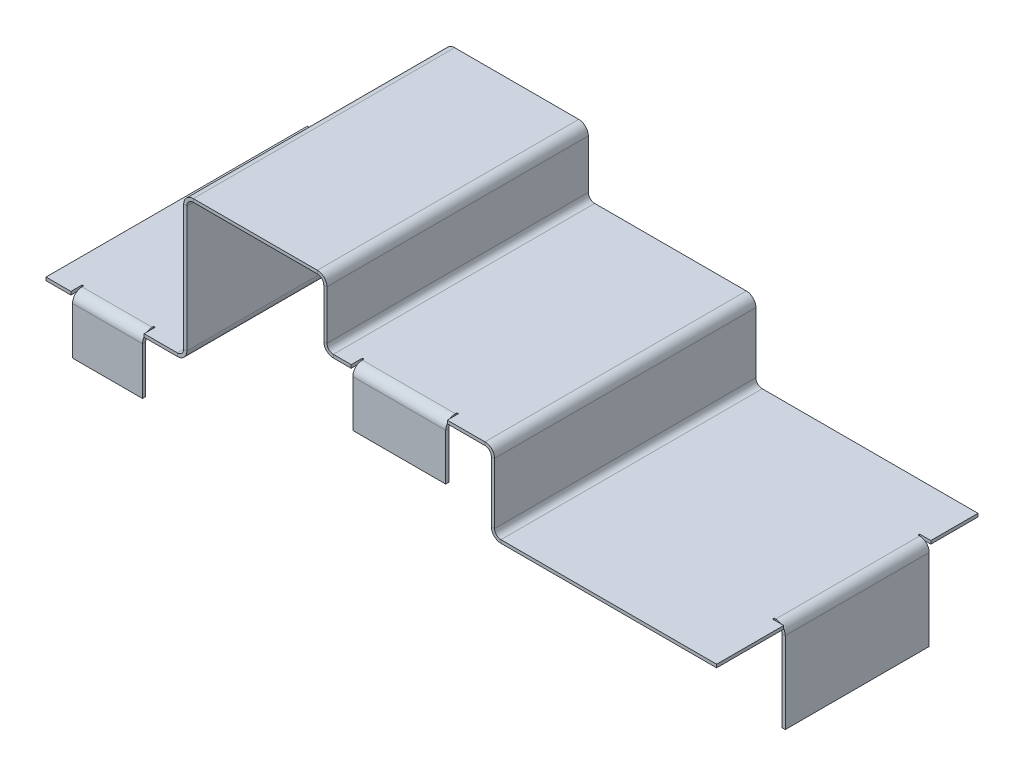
ISO-10303-21;
HEADER;
FILE_DESCRIPTION(('STEP AP214'),'2;1');
FILE_NAME('part.step','',(''),(''),'','','');
FILE_SCHEMA(('AUTOMOTIVE_DESIGN { 1 0 10303 214 1 1 1 1 }'));
ENDSEC;
DATA;
#1=APPLICATION_CONTEXT('core data for automotive mechanical design processes');
#2=APPLICATION_PROTOCOL_DEFINITION('international standard','automotive_design',2000,#1);
#3=PRODUCT_CONTEXT('',#1,'mechanical');
#4=PRODUCT('Part','Part','',(#3));
#5=PRODUCT_RELATED_PRODUCT_CATEGORY('part','',(#4));
#6=PRODUCT_DEFINITION_FORMATION('','',#4);
#7=PRODUCT_DEFINITION_CONTEXT('part definition',#1,'design');
#8=PRODUCT_DEFINITION('design','',#6,#7);
#9=PRODUCT_DEFINITION_SHAPE('','',#8);
#10=(LENGTH_UNIT() NAMED_UNIT(*) SI_UNIT(.MILLI.,.METRE.));
#11=(NAMED_UNIT(*) PLANE_ANGLE_UNIT() SI_UNIT($,.RADIAN.));
#12=(NAMED_UNIT(*) SI_UNIT($,.STERADIAN.) SOLID_ANGLE_UNIT());
#13=UNCERTAINTY_MEASURE_WITH_UNIT(LENGTH_MEASURE(1.E-05),#10,'distance_accuracy_value','');
#14=(GEOMETRIC_REPRESENTATION_CONTEXT(3) GLOBAL_UNCERTAINTY_ASSIGNED_CONTEXT((#13)) GLOBAL_UNIT_ASSIGNED_CONTEXT((#10,
#11,#12)) REPRESENTATION_CONTEXT('',''));
#15=CARTESIAN_POINT('',(0.,0.,0.));
#16=DIRECTION('',(0.,0.,1.));
#17=DIRECTION('',(1.,0.,0.));
#18=AXIS2_PLACEMENT_3D('',#15,#16,#17);
#19=CARTESIAN_POINT('',(106.627416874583,-28.5392722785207,19.4637902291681));
#20=DIRECTION('',(0.,-1.,0.));
#21=DIRECTION('',(1.,0.,0.));
#22=AXIS2_PLACEMENT_3D('',#19,#20,#21);
#23=PLANE('',#22);
#24=DIRECTION('',(1.,0.,0.));
#25=VECTOR('',#24,1.);
#26=CARTESIAN_POINT('',(106.627416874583,-28.5392722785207,-25.6969808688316));
#27=LINE('',#26,#25);
#28=CARTESIAN_POINT('',(209.39156626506,-28.5392722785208,-25.6969808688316));
#29=VERTEX_POINT('',#28);
#30=CARTESIAN_POINT('',(210.39156626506,-28.5392722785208,-25.6969808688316));
#31=VERTEX_POINT('',#30);
#32=EDGE_CURVE('E594',#29,#31,#27,.T.);
#33=ORIENTED_EDGE('',*,*,#32,.T.);
#34=DIRECTION('',(0.,0.,-1.));
#35=VECTOR('',#34,1.);
#36=CARTESIAN_POINT('',(210.39156626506,-28.5392722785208,19.4637902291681));
#37=LINE('',#36,#35);
#38=CARTESIAN_POINT('',(210.39156626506,-28.5392722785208,19.4637902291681));
#39=VERTEX_POINT('',#38);
#40=EDGE_CURVE('E587',#39,#31,#37,.T.);
#41=ORIENTED_EDGE('',*,*,#40,.F.);
#42=DIRECTION('',(1.,0.,0.));
#43=VECTOR('',#42,1.);
#44=CARTESIAN_POINT('',(106.627416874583,-28.5392722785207,19.4637902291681));
#45=LINE('',#44,#43);
#46=CARTESIAN_POINT('',(209.39156626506,-28.5392722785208,19.4637902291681));
#47=VERTEX_POINT('',#46);
#48=EDGE_CURVE('E582',#47,#39,#45,.T.);
#49=ORIENTED_EDGE('',*,*,#48,.F.);
#50=DIRECTION('',(0.,0.,-1.));
#51=VECTOR('',#50,1.);
#52=CARTESIAN_POINT('',(209.39156626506,-28.5392722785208,19.4637902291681));
#53=LINE('',#52,#51);
#54=EDGE_CURVE('E592',#47,#29,#53,.T.);
#55=ORIENTED_EDGE('',*,*,#54,.T.);
#56=EDGE_LOOP('',(#33,#41,#49,#55));
#57=FACE_BOUND('',#56,.T.);
#58=ADVANCED_FACE('F32',(#57),#23,.T.);
#59=CARTESIAN_POINT('',(106.627416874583,0.,-25.6969808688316));
#60=DIRECTION('',(0.,0.,-1.));
#61=DIRECTION('',(0.,1.,0.));
#62=AXIS2_PLACEMENT_3D('',#59,#60,#61);
#63=PLANE('',#62);
#64=DIRECTION('',(1.,0.,0.));
#65=VECTOR('',#64,1.);
#66=CARTESIAN_POINT('',(106.627416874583,-3.00000000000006,-25.6969808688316));
#67=LINE('',#66,#65);
#68=CARTESIAN_POINT('',(209.39156626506,-3.00000000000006,-25.6969808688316));
#69=VERTEX_POINT('',#68);
#70=CARTESIAN_POINT('',(210.39156626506,-3.00000000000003,-25.6969808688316));
#71=VERTEX_POINT('',#70);
#72=EDGE_CURVE('E590',#69,#71,#67,.T.);
#73=ORIENTED_EDGE('',*,*,#72,.T.);
#74=DIRECTION('',(0.,1.,0.));
#75=VECTOR('',#74,1.);
#76=CARTESIAN_POINT('',(210.39156626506,0.,-25.6969808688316));
#77=LINE('',#76,#75);
#78=EDGE_CURVE('E584',#31,#71,#77,.T.);
#79=ORIENTED_EDGE('',*,*,#78,.F.);
#80=ORIENTED_EDGE('',*,*,#32,.F.);
#81=DIRECTION('',(0.,1.,0.));
#82=VECTOR('',#81,1.);
#83=CARTESIAN_POINT('',(209.39156626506,0.,-25.6969808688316));
#84=LINE('',#83,#82);
#85=EDGE_CURVE('E75',#29,#69,#84,.T.);
#86=ORIENTED_EDGE('',*,*,#85,.T.);
#87=EDGE_LOOP('',(#73,#79,#80,#86));
#88=FACE_BOUND('',#87,.T.);
#89=ADVANCED_FACE('F1329',(#88),#63,.T.);
#90=CARTESIAN_POINT('',(210.39156626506,0.,41.));
#91=DIRECTION('',(1.,0.,0.));
#92=DIRECTION('',(0.,0.,-1.));
#93=AXIS2_PLACEMENT_3D('',#90,#91,#92);
#94=PLANE('',#93);
#95=DIRECTION('',(0.,0.,-1.));
#96=VECTOR('',#95,1.);
#97=CARTESIAN_POINT('',(210.39156626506,-3.00000000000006,-25.6969808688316));
#98=LINE('',#97,#96);
#99=CARTESIAN_POINT('',(210.39156626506,-3.00000000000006,19.4637902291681));
#100=VERTEX_POINT('',#99);
#101=EDGE_CURVE('E596',#100,#71,#98,.T.);
#102=ORIENTED_EDGE('',*,*,#101,.F.);
#103=DIRECTION('',(0.,1.,0.));
#104=VECTOR('',#103,1.);
#105=CARTESIAN_POINT('',(210.39156626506,0.,19.4637902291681));
#106=LINE('',#105,#104);
#107=EDGE_CURVE('E580',#39,#100,#106,.T.);
#108=ORIENTED_EDGE('',*,*,#107,.F.);
#109=ORIENTED_EDGE('',*,*,#40,.T.);
#110=ORIENTED_EDGE('',*,*,#78,.T.);
#111=EDGE_LOOP('',(#102,#108,#109,#110));
#112=FACE_BOUND('',#111,.T.);
#113=ADVANCED_FACE('F1335',(#112),#94,.T.);
#114=CARTESIAN_POINT('',(106.627416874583,0.,19.4637902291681));
#115=DIRECTION('',(0.,0.,1.));
#116=DIRECTION('',(0.,-1.,0.));
#117=AXIS2_PLACEMENT_3D('',#114,#115,#116);
#118=PLANE('',#117);
#119=ORIENTED_EDGE('',*,*,#48,.T.);
#120=ORIENTED_EDGE('',*,*,#107,.T.);
#121=DIRECTION('',(1.,0.,0.));
#122=VECTOR('',#121,1.);
#123=CARTESIAN_POINT('',(106.627416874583,-3.00000000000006,19.4637902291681));
#124=LINE('',#123,#122);
#125=CARTESIAN_POINT('',(209.39156626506,-3.00000000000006,19.4637902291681));
#126=VERTEX_POINT('',#125);
#127=EDGE_CURVE('E36',#126,#100,#124,.T.);
#128=ORIENTED_EDGE('',*,*,#127,.F.);
#129=DIRECTION('',(0.,1.,0.));
#130=VECTOR('',#129,1.);
#131=CARTESIAN_POINT('',(209.39156626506,0.,19.4637902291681));
#132=LINE('',#131,#130);
#133=EDGE_CURVE('E42',#47,#126,#132,.T.);
#134=ORIENTED_EDGE('',*,*,#133,.F.);
#135=EDGE_LOOP('',(#119,#120,#128,#134));
#136=FACE_BOUND('',#135,.T.);
#137=ADVANCED_FACE('F1341',(#136),#118,.T.);
#138=CARTESIAN_POINT('',(209.39156626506,-28.5392722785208,19.4637902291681));
#139=DIRECTION('',(1.,0.,0.));
#140=DIRECTION('',(0.,0.,-1.));
#141=AXIS2_PLACEMENT_3D('',#138,#139,#140);
#142=PLANE('',#141);
#143=ORIENTED_EDGE('',*,*,#133,.T.);
#144=DIRECTION('',(0.,0.,-1.));
#145=VECTOR('',#144,1.);
#146=CARTESIAN_POINT('',(209.39156626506,-3.00000000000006,-25.6969808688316));
#147=LINE('',#146,#145);
#148=EDGE_CURVE('E11',#126,#69,#147,.T.);
#149=ORIENTED_EDGE('',*,*,#148,.T.);
#150=ORIENTED_EDGE('',*,*,#85,.F.);
#151=ORIENTED_EDGE('',*,*,#54,.F.);
#152=EDGE_LOOP('',(#143,#149,#150,#151));
#153=FACE_BOUND('',#152,.T.);
#154=ADVANCED_FACE('F34',(#153),#142,.F.);
#155=CARTESIAN_POINT('',(206.891566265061,212.641888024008,40.9999999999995));
#156=DIRECTION('',(-1.,0.,0.));
#157=DIRECTION('',(0.,0.,1.));
#158=AXIS2_PLACEMENT_3D('',#155,#156,#157);
#159=PLANE('',#158);
#160=DIRECTION('',(0.,-1.,0.));
#161=VECTOR('',#160,1.);
#162=CARTESIAN_POINT('',(206.89156626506,212.641888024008,-25.6969808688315));
#163=LINE('',#162,#161);
#164=CARTESIAN_POINT('',(206.89156626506,0.,-25.6969808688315));
#165=VERTEX_POINT('',#164);
#166=CARTESIAN_POINT('',(206.89156626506,-1.,-25.6969808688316));
#167=VERTEX_POINT('',#166);
#168=EDGE_CURVE('E571',#165,#167,#163,.T.);
#169=ORIENTED_EDGE('',*,*,#168,.T.);
#170=DIRECTION('',(0.,0.,-1.));
#171=VECTOR('',#170,1.);
#172=CARTESIAN_POINT('',(206.891566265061,-1.,40.9999999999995));
#173=LINE('',#172,#171);
#174=CARTESIAN_POINT('',(206.89156626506,-1.,-26.1969808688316));
#175=VERTEX_POINT('',#174);
#176=EDGE_CURVE('E568',#167,#175,#173,.T.);
#177=ORIENTED_EDGE('',*,*,#176,.T.);
#178=DIRECTION('',(0.,-1.,0.));
#179=VECTOR('',#178,1.);
#180=CARTESIAN_POINT('',(206.89156626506,212.641888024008,-26.1969808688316));
#181=LINE('',#180,#179);
#182=CARTESIAN_POINT('',(206.89156626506,0.,-26.1969808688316));
#183=VERTEX_POINT('',#182);
#184=EDGE_CURVE('E566',#183,#175,#181,.T.);
#185=ORIENTED_EDGE('',*,*,#184,.F.);
#186=DIRECTION('',(0.,0.,-1.));
#187=VECTOR('',#186,1.);
#188=CARTESIAN_POINT('',(206.891566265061,0.,40.9999999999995));
#189=LINE('',#188,#187);
#190=EDGE_CURVE('E145',#165,#183,#189,.T.);
#191=ORIENTED_EDGE('',*,*,#190,.F.);
#192=EDGE_LOOP('',(#169,#177,#185,#191));
#193=FACE_BOUND('',#192,.T.);
#194=ADVANCED_FACE('F646',(#193),#159,.F.);
#195=CARTESIAN_POINT('',(140.714811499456,212.641888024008,-26.1969808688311));
#196=DIRECTION('',(0.,0.,-1.));
#197=DIRECTION('',(-1.,0.,0.));
#198=AXIS2_PLACEMENT_3D('',#195,#196,#197);
#199=PLANE('',#198);
#200=ORIENTED_EDGE('',*,*,#184,.T.);
#201=DIRECTION('',(1.,0.,0.));
#202=VECTOR('',#201,1.);
#203=CARTESIAN_POINT('',(140.714811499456,-1.,-26.1969808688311));
#204=LINE('',#203,#202);
#205=CARTESIAN_POINT('',(210.39156626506,-1.,-26.1969808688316));
#206=VERTEX_POINT('',#205);
#207=EDGE_CURVE('E563',#175,#206,#204,.T.);
#208=ORIENTED_EDGE('',*,*,#207,.T.);
#209=DIRECTION('',(0.,-1.,0.));
#210=VECTOR('',#209,1.);
#211=CARTESIAN_POINT('',(210.39156626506,212.641888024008,-26.1969808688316));
#212=LINE('',#211,#210);
#213=CARTESIAN_POINT('',(210.39156626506,0.,-26.1969808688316));
#214=VERTEX_POINT('',#213);
#215=EDGE_CURVE('E560',#214,#206,#212,.T.);
#216=ORIENTED_EDGE('',*,*,#215,.F.);
#217=DIRECTION('',(1.,0.,0.));
#218=VECTOR('',#217,1.);
#219=CARTESIAN_POINT('',(140.714811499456,0.,-26.1969808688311));
#220=LINE('',#219,#218);
#221=EDGE_CURVE('E138',#183,#214,#220,.T.);
#222=ORIENTED_EDGE('',*,*,#221,.F.);
#223=EDGE_LOOP('',(#200,#208,#216,#222));
#224=FACE_BOUND('',#223,.T.);
#225=ADVANCED_FACE('F647',(#224),#199,.F.);
#226=CARTESIAN_POINT('',(210.39156626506,212.641888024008,41.));
#227=DIRECTION('',(-1.,0.,0.));
#228=DIRECTION('',(0.,0.,1.));
#229=AXIS2_PLACEMENT_3D('',#226,#227,#228);
#230=PLANE('',#229);
#231=ORIENTED_EDGE('',*,*,#215,.T.);
#232=DIRECTION('',(0.,0.,-1.));
#233=VECTOR('',#232,1.);
#234=CARTESIAN_POINT('',(210.39156626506,-1.,41.));
#235=LINE('',#234,#233);
#236=CARTESIAN_POINT('',(210.39156626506,-1.,-41.));
#237=VERTEX_POINT('',#236);
#238=EDGE_CURVE('E559',#206,#237,#235,.T.);
#239=ORIENTED_EDGE('',*,*,#238,.T.);
#240=DIRECTION('',(0.,-1.,0.));
#241=VECTOR('',#240,1.);
#242=CARTESIAN_POINT('',(210.39156626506,212.641888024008,-41.));
#243=LINE('',#242,#241);
#244=CARTESIAN_POINT('',(210.39156626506,0.,-41.));
#245=VERTEX_POINT('',#244);
#246=EDGE_CURVE('E626',#245,#237,#243,.T.);
#247=ORIENTED_EDGE('',*,*,#246,.F.);
#248=DIRECTION('',(0.,0.,-1.));
#249=VECTOR('',#248,1.);
#250=CARTESIAN_POINT('',(210.39156626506,0.,41.));
#251=LINE('',#250,#249);
#252=EDGE_CURVE('E618',#214,#245,#251,.T.);
#253=ORIENTED_EDGE('',*,*,#252,.F.);
#254=EDGE_LOOP('',(#231,#239,#247,#253));
#255=FACE_BOUND('',#254,.T.);
#256=ADVANCED_FACE('F650',(#255),#230,.F.);
#257=CARTESIAN_POINT('',(140.714811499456,212.641888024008,19.9637902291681));
#258=DIRECTION('',(0.,0.,1.));
#259=DIRECTION('',(1.,0.,0.));
#260=AXIS2_PLACEMENT_3D('',#257,#258,#259);
#261=PLANE('',#260);
#262=DIRECTION('',(0.,-1.,0.));
#263=VECTOR('',#262,1.);
#264=CARTESIAN_POINT('',(210.39156626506,212.641888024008,19.9637902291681));
#265=LINE('',#264,#263);
#266=CARTESIAN_POINT('',(210.39156626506,0.,19.9637902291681));
#267=VERTEX_POINT('',#266);
#268=CARTESIAN_POINT('',(210.39156626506,-1.,19.9637902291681));
#269=VERTEX_POINT('',#268);
#270=EDGE_CURVE('E556',#267,#269,#265,.T.);
#271=ORIENTED_EDGE('',*,*,#270,.T.);
#272=DIRECTION('',(-1.,0.,0.));
#273=VECTOR('',#272,1.);
#274=CARTESIAN_POINT('',(140.714811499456,-1.,19.9637902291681));
#275=LINE('',#274,#273);
#276=CARTESIAN_POINT('',(206.89156626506,-1.,19.9637902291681));
#277=VERTEX_POINT('',#276);
#278=EDGE_CURVE('E553',#269,#277,#275,.T.);
#279=ORIENTED_EDGE('',*,*,#278,.T.);
#280=DIRECTION('',(0.,-1.,0.));
#281=VECTOR('',#280,1.);
#282=CARTESIAN_POINT('',(206.89156626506,212.641888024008,19.9637902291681));
#283=LINE('',#282,#281);
#284=CARTESIAN_POINT('',(206.89156626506,0.,19.9637902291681));
#285=VERTEX_POINT('',#284);
#286=EDGE_CURVE('E550',#285,#277,#283,.T.);
#287=ORIENTED_EDGE('',*,*,#286,.F.);
#288=DIRECTION('',(-1.,0.,0.));
#289=VECTOR('',#288,1.);
#290=CARTESIAN_POINT('',(140.714811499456,0.,19.9637902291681));
#291=LINE('',#290,#289);
#292=EDGE_CURVE('E606',#267,#285,#291,.T.);
#293=ORIENTED_EDGE('',*,*,#292,.F.);
#294=EDGE_LOOP('',(#271,#279,#287,#293));
#295=FACE_BOUND('',#294,.T.);
#296=ADVANCED_FACE('F1857',(#295),#261,.F.);
#297=CARTESIAN_POINT('',(206.89156626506,212.641888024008,41.));
#298=DIRECTION('',(-1.,0.,0.));
#299=DIRECTION('',(0.,0.,1.));
#300=AXIS2_PLACEMENT_3D('',#297,#298,#299);
#301=PLANE('',#300);
#302=ORIENTED_EDGE('',*,*,#286,.T.);
#303=DIRECTION('',(0.,0.,-1.));
#304=VECTOR('',#303,1.);
#305=CARTESIAN_POINT('',(206.89156626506,-1.,41.));
#306=LINE('',#305,#304);
#307=CARTESIAN_POINT('',(206.89156626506,-1.,19.4637902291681));
#308=VERTEX_POINT('',#307);
#309=EDGE_CURVE('E545',#277,#308,#306,.T.);
#310=ORIENTED_EDGE('',*,*,#309,.T.);
#311=DIRECTION('',(0.,-1.,0.));
#312=VECTOR('',#311,1.);
#313=CARTESIAN_POINT('',(206.89156626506,212.641888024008,19.4637902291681));
#314=LINE('',#313,#312);
#315=CARTESIAN_POINT('',(206.89156626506,0.,19.4637902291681));
#316=VERTEX_POINT('',#315);
#317=EDGE_CURVE('E541',#316,#308,#314,.T.);
#318=ORIENTED_EDGE('',*,*,#317,.F.);
#319=DIRECTION('',(0.,0.,-1.));
#320=VECTOR('',#319,1.);
#321=CARTESIAN_POINT('',(206.89156626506,0.,41.));
#322=LINE('',#321,#320);
#323=EDGE_CURVE('E601',#285,#316,#322,.T.);
#324=ORIENTED_EDGE('',*,*,#323,.F.);
#325=EDGE_LOOP('',(#302,#310,#318,#324));
#326=FACE_BOUND('',#325,.T.);
#327=ADVANCED_FACE('F1861',(#326),#301,.F.);
#328=CARTESIAN_POINT('',(140.714811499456,212.641888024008,19.4637902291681));
#329=DIRECTION('',(0.,0.,-1.));
#330=DIRECTION('',(-1.,0.,0.));
#331=AXIS2_PLACEMENT_3D('',#328,#329,#330);
#332=PLANE('',#331);
#333=ORIENTED_EDGE('',*,*,#317,.T.);
#334=DIRECTION('',(1.,0.,0.));
#335=VECTOR('',#334,1.);
#336=CARTESIAN_POINT('',(140.714811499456,-1.,19.4637902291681));
#337=LINE('',#336,#335);
#338=CARTESIAN_POINT('',(207.39156626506,-1.00000000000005,19.4637902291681));
#339=VERTEX_POINT('',#338);
#340=EDGE_CURVE('E530',#308,#339,#337,.T.);
#341=ORIENTED_EDGE('',*,*,#340,.T.);
#342=DIRECTION('',(0.,-1.,0.));
#343=VECTOR('',#342,1.);
#344=CARTESIAN_POINT('',(207.39156626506,212.641888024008,19.4637902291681));
#345=LINE('',#344,#343);
#346=CARTESIAN_POINT('',(207.39156626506,0.,19.4637902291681));
#347=VERTEX_POINT('',#346);
#348=EDGE_CURVE('E506',#347,#339,#345,.T.);
#349=ORIENTED_EDGE('',*,*,#348,.F.);
#350=DIRECTION('',(1.,0.,0.));
#351=VECTOR('',#350,1.);
#352=CARTESIAN_POINT('',(140.714811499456,0.,19.4637902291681));
#353=LINE('',#352,#351);
#354=EDGE_CURVE('E600',#316,#347,#353,.T.);
#355=ORIENTED_EDGE('',*,*,#354,.F.);
#356=EDGE_LOOP('',(#333,#341,#349,#355));
#357=FACE_BOUND('',#356,.T.);
#358=ADVANCED_FACE('F539',(#357),#332,.F.);
#359=CARTESIAN_POINT('',(140.714811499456,212.641888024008,-25.6969808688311));
#360=DIRECTION('',(0.,0.,1.));
#361=DIRECTION('',(1.,0.,0.));
#362=AXIS2_PLACEMENT_3D('',#359,#360,#361);
#363=PLANE('',#362);
#364=DIRECTION('',(0.,-1.,0.));
#365=VECTOR('',#364,1.);
#366=CARTESIAN_POINT('',(207.39156626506,212.641888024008,-25.6969808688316));
#367=LINE('',#366,#365);
#368=CARTESIAN_POINT('',(207.39156626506,0.,-25.6969808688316));
#369=VERTEX_POINT('',#368);
#370=CARTESIAN_POINT('',(207.39156626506,-1.,-25.6969808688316));
#371=VERTEX_POINT('',#370);
#372=EDGE_CURVE('E542',#369,#371,#367,.T.);
#373=ORIENTED_EDGE('',*,*,#372,.T.);
#374=DIRECTION('',(-1.,0.,0.));
#375=VECTOR('',#374,1.);
#376=CARTESIAN_POINT('',(140.714811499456,-1.,-25.6969808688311));
#377=LINE('',#376,#375);
#378=EDGE_CURVE('E533',#371,#167,#377,.T.);
#379=ORIENTED_EDGE('',*,*,#378,.T.);
#380=ORIENTED_EDGE('',*,*,#168,.F.);
#381=DIRECTION('',(-1.,0.,0.));
#382=VECTOR('',#381,1.);
#383=CARTESIAN_POINT('',(140.714811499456,0.,-25.6969808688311));
#384=LINE('',#383,#382);
#385=EDGE_CURVE('E623',#369,#165,#384,.T.);
#386=ORIENTED_EDGE('',*,*,#385,.F.);
#387=EDGE_LOOP('',(#373,#379,#380,#386));
#388=FACE_BOUND('',#387,.T.);
#389=ADVANCED_FACE('F644',(#388),#363,.F.);
#390=DIRECTION('',(0.,-1.,0.));
#391=VECTOR('',#390,1.);
#392=CARTESIAN_POINT('',(210.39156626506,212.641888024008,41.));
#393=LINE('',#392,#391);
#394=CARTESIAN_POINT('',(210.39156626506,0.,41.));
#395=VERTEX_POINT('',#394);
#396=CARTESIAN_POINT('',(210.39156626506,-1.,41.));
#397=VERTEX_POINT('',#396);
#398=EDGE_CURVE('E641',#395,#397,#393,.T.);
#399=ORIENTED_EDGE('',*,*,#398,.T.);
#400=EDGE_CURVE('E638',#397,#269,#235,.T.);
#401=ORIENTED_EDGE('',*,*,#400,.T.);
#402=ORIENTED_EDGE('',*,*,#270,.F.);
#403=EDGE_CURVE('E614',#395,#267,#251,.T.);
#404=ORIENTED_EDGE('',*,*,#403,.F.);
#405=EDGE_LOOP('',(#399,#401,#402,#404));
#406=FACE_BOUND('',#405,.T.);
#407=ADVANCED_FACE('F1858',(#406),#230,.F.);
#408=CARTESIAN_POINT('',(140.714811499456,212.641888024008,41.));
#409=DIRECTION('',(0.,0.,-1.));
#410=DIRECTION('',(-1.,0.,0.));
#411=AXIS2_PLACEMENT_3D('',#408,#409,#410);
#412=PLANE('',#411);
#413=DIRECTION('',(0.,-1.,0.));
#414=VECTOR('',#413,1.);
#415=CARTESIAN_POINT('',(142.714811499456,212.641888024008,41.));
#416=LINE('',#415,#414);
#417=CARTESIAN_POINT('',(142.714811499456,0.,41.));
#418=VERTEX_POINT('',#417);
#419=CARTESIAN_POINT('',(142.714811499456,-0.999999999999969,41.));
#420=VERTEX_POINT('',#419);
#421=EDGE_CURVE('E635',#418,#420,#416,.T.);
#422=ORIENTED_EDGE('',*,*,#421,.T.);
#423=DIRECTION('',(1.,0.,0.));
#424=VECTOR('',#423,1.);
#425=CARTESIAN_POINT('',(140.714811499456,-1.,41.));
#426=LINE('',#425,#424);
#427=EDGE_CURVE('E536',#420,#397,#426,.T.);
#428=ORIENTED_EDGE('',*,*,#427,.T.);
#429=ORIENTED_EDGE('',*,*,#398,.F.);
#430=DIRECTION('',(1.,0.,0.));
#431=VECTOR('',#430,1.);
#432=CARTESIAN_POINT('',(140.714811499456,0.,41.));
#433=LINE('',#432,#431);
#434=EDGE_CURVE('E617',#418,#395,#433,.T.);
#435=ORIENTED_EDGE('',*,*,#434,.F.);
#436=EDGE_LOOP('',(#422,#428,#429,#435));
#437=FACE_BOUND('',#436,.T.);
#438=ADVANCED_FACE('F1870',(#437),#412,.F.);
#439=CARTESIAN_POINT('',(140.714811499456,-1.,41.));
#440=DIRECTION('',(0.,1.,0.));
#441=DIRECTION('',(0.,0.,1.));
#442=AXIS2_PLACEMENT_3D('',#439,#440,#441);
#443=PLANE('',#442);
#444=ORIENTED_EDGE('',*,*,#378,.F.);
#445=DIRECTION('',(0.,0.,1.));
#446=VECTOR('',#445,1.);
#447=CARTESIAN_POINT('',(207.39156626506,-1.,-25.6969808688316));
#448=LINE('',#447,#446);
#449=EDGE_CURVE('E524',#371,#339,#448,.T.);
#450=ORIENTED_EDGE('',*,*,#449,.T.);
#451=ORIENTED_EDGE('',*,*,#340,.F.);
#452=ORIENTED_EDGE('',*,*,#309,.F.);
#453=ORIENTED_EDGE('',*,*,#278,.F.);
#454=ORIENTED_EDGE('',*,*,#400,.F.);
#455=ORIENTED_EDGE('',*,*,#427,.F.);
#456=DIRECTION('',(0.,0.,-1.));
#457=VECTOR('',#456,1.);
#458=CARTESIAN_POINT('',(142.714811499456,-1.,41.));
#459=LINE('',#458,#457);
#460=CARTESIAN_POINT('',(142.714811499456,-1.,-41.));
#461=VERTEX_POINT('',#460);
#462=EDGE_CURVE('E535',#420,#461,#459,.T.);
#463=ORIENTED_EDGE('',*,*,#462,.T.);
#464=DIRECTION('',(1.,0.,0.));
#465=VECTOR('',#464,1.);
#466=CARTESIAN_POINT('',(140.714811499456,-1.,-41.));
#467=LINE('',#466,#465);
#468=EDGE_CURVE('E629',#461,#237,#467,.T.);
#469=ORIENTED_EDGE('',*,*,#468,.T.);
#470=ORIENTED_EDGE('',*,*,#238,.F.);
#471=ORIENTED_EDGE('',*,*,#207,.F.);
#472=ORIENTED_EDGE('',*,*,#176,.F.);
#473=EDGE_LOOP('',(#444,#450,#451,#452,#453,#454,#455,#463,#469,#470,#471,#472));
#474=FACE_BOUND('',#473,.T.);
#475=ADVANCED_FACE('F529',(#474),#443,.F.);
#476=CARTESIAN_POINT('',(140.714811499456,212.641888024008,-41.));
#477=DIRECTION('',(0.,0.,-1.));
#478=DIRECTION('',(-1.,0.,0.));
#479=AXIS2_PLACEMENT_3D('',#476,#477,#478);
#480=PLANE('',#479);
#481=ORIENTED_EDGE('',*,*,#468,.F.);
#482=DIRECTION('',(0.,-1.,0.));
#483=VECTOR('',#482,1.);
#484=CARTESIAN_POINT('',(142.714811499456,212.641888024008,-41.));
#485=LINE('',#484,#483);
#486=CARTESIAN_POINT('',(142.714811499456,0.,-41.));
#487=VERTEX_POINT('',#486);
#488=EDGE_CURVE('E517',#487,#461,#485,.T.);
#489=ORIENTED_EDGE('',*,*,#488,.F.);
#490=DIRECTION('',(1.,0.,0.));
#491=VECTOR('',#490,1.);
#492=CARTESIAN_POINT('',(140.714811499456,0.,-41.));
#493=LINE('',#492,#491);
#494=EDGE_CURVE('E83',#487,#245,#493,.T.);
#495=ORIENTED_EDGE('',*,*,#494,.T.);
#496=ORIENTED_EDGE('',*,*,#246,.T.);
#497=EDGE_LOOP('',(#481,#489,#495,#496));
#498=FACE_BOUND('',#497,.T.);
#499=ADVANCED_FACE('F1875',(#498),#480,.T.);
#500=CARTESIAN_POINT('',(140.714811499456,0.,41.));
#501=DIRECTION('',(0.,1.,0.));
#502=DIRECTION('',(0.,0.,1.));
#503=AXIS2_PLACEMENT_3D('',#500,#501,#502);
#504=PLANE('',#503);
#505=DIRECTION('',(0.,0.,1.));
#506=VECTOR('',#505,1.);
#507=CARTESIAN_POINT('',(207.39156626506,0.,-25.6969808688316));
#508=LINE('',#507,#506);
#509=EDGE_CURVE('E516',#369,#347,#508,.T.);
#510=ORIENTED_EDGE('',*,*,#509,.F.);
#511=ORIENTED_EDGE('',*,*,#385,.T.);
#512=ORIENTED_EDGE('',*,*,#190,.T.);
#513=ORIENTED_EDGE('',*,*,#221,.T.);
#514=ORIENTED_EDGE('',*,*,#252,.T.);
#515=ORIENTED_EDGE('',*,*,#494,.F.);
#516=DIRECTION('',(0.,0.,-1.));
#517=VECTOR('',#516,1.);
#518=CARTESIAN_POINT('',(142.714811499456,0.,41.));
#519=LINE('',#518,#517);
#520=EDGE_CURVE('E576',#418,#487,#519,.T.);
#521=ORIENTED_EDGE('',*,*,#520,.F.);
#522=ORIENTED_EDGE('',*,*,#434,.T.);
#523=ORIENTED_EDGE('',*,*,#403,.T.);
#524=ORIENTED_EDGE('',*,*,#292,.T.);
#525=ORIENTED_EDGE('',*,*,#323,.T.);
#526=ORIENTED_EDGE('',*,*,#354,.T.);
#527=EDGE_LOOP('',(#510,#511,#512,#513,#514,#515,#521,#522,#523,#524,#525,#526));
#528=FACE_BOUND('',#527,.T.);
#529=ADVANCED_FACE('F652',(#528),#504,.T.);
#530=CARTESIAN_POINT('',(-27.6614786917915,24.0694461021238,-41.));
#531=DIRECTION('',(0.,0.,1.));
#532=DIRECTION('',(0.,-1.,0.));
#533=AXIS2_PLACEMENT_3D('',#530,#531,#532);
#534=PLANE('',#533);
#535=DIRECTION('',(0.,1.,0.));
#536=VECTOR('',#535,1.);
#537=CARTESIAN_POINT('',(140.714811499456,24.0694461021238,-41.));
#538=LINE('',#537,#536);
#539=CARTESIAN_POINT('',(140.714811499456,2.00000000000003,-41.));
#540=VERTEX_POINT('',#539);
#541=CARTESIAN_POINT('',(140.714811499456,21.0694461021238,-41.));
#542=VERTEX_POINT('',#541);
#543=EDGE_CURVE('E1111',#540,#542,#538,.T.);
#544=ORIENTED_EDGE('',*,*,#543,.F.);
#545=DIRECTION('',(1.,0.,0.));
#546=VECTOR('',#545,1.);
#547=CARTESIAN_POINT('',(-27.6614786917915,2.00000000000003,-41.));
#548=LINE('',#547,#546);
#549=CARTESIAN_POINT('',(139.714811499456,2.00000000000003,-41.));
#550=VERTEX_POINT('',#549);
#551=EDGE_CURVE('E1118',#550,#540,#548,.T.);
#552=ORIENTED_EDGE('',*,*,#551,.F.);
#553=DIRECTION('',(0.,1.,0.));
#554=VECTOR('',#553,1.);
#555=CARTESIAN_POINT('',(139.714811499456,24.0694461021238,-41.));
#556=LINE('',#555,#554);
#557=CARTESIAN_POINT('',(139.714811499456,21.0694461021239,-41.));
#558=VERTEX_POINT('',#557);
#559=EDGE_CURVE('E1116',#550,#558,#556,.T.);
#560=ORIENTED_EDGE('',*,*,#559,.T.);
#561=DIRECTION('',(1.,0.,0.));
#562=VECTOR('',#561,1.);
#563=CARTESIAN_POINT('',(-27.6614786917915,21.0694461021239,-41.));
#564=LINE('',#563,#562);
#565=EDGE_CURVE('E1113',#558,#542,#564,.T.);
#566=ORIENTED_EDGE('',*,*,#565,.T.);
#567=EDGE_LOOP('',(#544,#552,#560,#566));
#568=FACE_BOUND('',#567,.T.);
#569=ADVANCED_FACE('F1838',(#568),#534,.F.);
#570=CARTESIAN_POINT('',(140.714811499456,24.0694461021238,41.));
#571=DIRECTION('',(1.,0.,0.));
#572=DIRECTION('',(0.,0.,-1.));
#573=AXIS2_PLACEMENT_3D('',#570,#571,#572);
#574=PLANE('',#573);
#575=DIRECTION('',(0.,0.,1.));
#576=VECTOR('',#575,1.);
#577=CARTESIAN_POINT('',(140.714811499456,2.00000000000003,41.));
#578=LINE('',#577,#576);
#579=CARTESIAN_POINT('',(140.714811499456,2.00000000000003,41.));
#580=VERTEX_POINT('',#579);
#581=EDGE_CURVE('E1120',#540,#580,#578,.T.);
#582=ORIENTED_EDGE('',*,*,#581,.F.);
#583=ORIENTED_EDGE('',*,*,#543,.T.);
#584=DIRECTION('',(0.,0.,-1.));
#585=VECTOR('',#584,1.);
#586=CARTESIAN_POINT('',(140.714811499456,21.0694461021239,-41.));
#587=LINE('',#586,#585);
#588=CARTESIAN_POINT('',(140.714811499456,21.0694461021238,41.));
#589=VERTEX_POINT('',#588);
#590=EDGE_CURVE('E1121',#589,#542,#587,.T.);
#591=ORIENTED_EDGE('',*,*,#590,.F.);
#592=DIRECTION('',(0.,-1.,0.));
#593=VECTOR('',#592,1.);
#594=CARTESIAN_POINT('',(140.714811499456,24.0694461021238,41.));
#595=LINE('',#594,#593);
#596=EDGE_CURVE('E1108',#589,#580,#595,.T.);
#597=ORIENTED_EDGE('',*,*,#596,.T.);
#598=EDGE_LOOP('',(#582,#583,#591,#597));
#599=FACE_BOUND('',#598,.T.);
#600=ADVANCED_FACE('F1841',(#599),#574,.T.);
#601=CARTESIAN_POINT('',(-27.6614786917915,24.0694461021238,41.));
#602=DIRECTION('',(0.,0.,1.));
#603=DIRECTION('',(0.,-1.,0.));
#604=AXIS2_PLACEMENT_3D('',#601,#602,#603);
#605=PLANE('',#604);
#606=DIRECTION('',(1.,0.,0.));
#607=VECTOR('',#606,1.);
#608=CARTESIAN_POINT('',(-27.6614786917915,2.00000000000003,41.));
#609=LINE('',#608,#607);
#610=CARTESIAN_POINT('',(139.714811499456,2.00000000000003,41.));
#611=VERTEX_POINT('',#610);
#612=EDGE_CURVE('E1105',#611,#580,#609,.T.);
#613=ORIENTED_EDGE('',*,*,#612,.T.);
#614=ORIENTED_EDGE('',*,*,#596,.F.);
#615=DIRECTION('',(1.,0.,0.));
#616=VECTOR('',#615,1.);
#617=CARTESIAN_POINT('',(-27.6614786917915,21.0694461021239,41.));
#618=LINE('',#617,#616);
#619=CARTESIAN_POINT('',(139.714811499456,21.0694461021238,41.));
#620=VERTEX_POINT('',#619);
#621=EDGE_CURVE('E609',#620,#589,#618,.T.);
#622=ORIENTED_EDGE('',*,*,#621,.F.);
#623=DIRECTION('',(0.,1.,0.));
#624=VECTOR('',#623,1.);
#625=CARTESIAN_POINT('',(139.714811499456,24.0694461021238,41.));
#626=LINE('',#625,#624);
#627=EDGE_CURVE('E167',#620,#611,#626,.F.);
#628=ORIENTED_EDGE('',*,*,#627,.T.);
#629=EDGE_LOOP('',(#613,#614,#622,#628));
#630=FACE_BOUND('',#629,.T.);
#631=ADVANCED_FACE('F1845',(#630),#605,.T.);
#632=CARTESIAN_POINT('',(139.714811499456,24.0694461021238,41.));
#633=DIRECTION('',(1.,0.,0.));
#634=DIRECTION('',(0.,0.,-1.));
#635=AXIS2_PLACEMENT_3D('',#632,#633,#634);
#636=PLANE('',#635);
#637=ORIENTED_EDGE('',*,*,#559,.F.);
#638=DIRECTION('',(0.,0.,1.));
#639=VECTOR('',#638,1.);
#640=CARTESIAN_POINT('',(139.714811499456,2.00000000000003,41.));
#641=LINE('',#640,#639);
#642=EDGE_CURVE('E1102',#550,#611,#641,.T.);
#643=ORIENTED_EDGE('',*,*,#642,.T.);
#644=ORIENTED_EDGE('',*,*,#627,.F.);
#645=DIRECTION('',(0.,0.,-1.));
#646=VECTOR('',#645,1.);
#647=CARTESIAN_POINT('',(139.714811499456,21.0694461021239,-41.));
#648=LINE('',#647,#646);
#649=EDGE_CURVE('E172',#620,#558,#648,.T.);
#650=ORIENTED_EDGE('',*,*,#649,.T.);
#651=EDGE_LOOP('',(#637,#643,#644,#650));
#652=FACE_BOUND('',#651,.T.);
#653=ADVANCED_FACE('F1825',(#652),#636,.F.);
#654=CARTESIAN_POINT('',(96.2522752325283,6.43664957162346,-24.2430232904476));
#655=DIRECTION('',(0.,-1.,0.));
#656=DIRECTION('',(0.,0.,-1.));
#657=AXIS2_PLACEMENT_3D('',#654,#655,#656);
#658=PLANE('',#657);
#659=DIRECTION('',(1.,0.,0.));
#660=VECTOR('',#659,1.);
#661=CARTESIAN_POINT('',(96.2522752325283,6.43664957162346,41.));
#662=LINE('',#661,#660);
#663=CARTESIAN_POINT('',(96.2522752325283,6.43664957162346,41.));
#664=VERTEX_POINT('',#663);
#665=CARTESIAN_POINT('',(125.407794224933,6.43664957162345,41.));
#666=VERTEX_POINT('',#665);
#667=EDGE_CURVE('E1080',#664,#666,#662,.T.);
#668=ORIENTED_EDGE('',*,*,#667,.F.);
#669=DIRECTION('',(0.,0.,1.));
#670=VECTOR('',#669,1.);
#671=CARTESIAN_POINT('',(96.2522752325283,6.43664957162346,-24.2430232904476));
#672=LINE('',#671,#670);
#673=CARTESIAN_POINT('',(96.2522752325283,6.43664957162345,40.));
#674=VERTEX_POINT('',#673);
#675=EDGE_CURVE('E181',#674,#664,#672,.T.);
#676=ORIENTED_EDGE('',*,*,#675,.F.);
#677=DIRECTION('',(1.,0.,0.));
#678=VECTOR('',#677,1.);
#679=CARTESIAN_POINT('',(96.2522752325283,6.43664957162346,40.));
#680=LINE('',#679,#678);
#681=CARTESIAN_POINT('',(125.407794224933,6.43664957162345,40.));
#682=VERTEX_POINT('',#681);
#683=EDGE_CURVE('E202',#674,#682,#680,.T.);
#684=ORIENTED_EDGE('',*,*,#683,.T.);
#685=DIRECTION('',(0.,0.,1.));
#686=VECTOR('',#685,1.);
#687=CARTESIAN_POINT('',(125.407794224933,6.43664957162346,-24.2430232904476));
#688=LINE('',#687,#686);
#689=EDGE_CURVE('E1095',#682,#666,#688,.T.);
#690=ORIENTED_EDGE('',*,*,#689,.T.);
#691=EDGE_LOOP('',(#668,#676,#684,#690));
#692=FACE_BOUND('',#691,.T.);
#693=ADVANCED_FACE('F1821',(#692),#658,.T.);
#694=CARTESIAN_POINT('',(125.407794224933,24.0694461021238,-24.2430232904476));
#695=DIRECTION('',(1.,0.,0.));
#696=DIRECTION('',(0.,1.,0.));
#697=AXIS2_PLACEMENT_3D('',#694,#695,#696);
#698=PLANE('',#697);
#699=DIRECTION('',(0.,1.,0.));
#700=VECTOR('',#699,1.);
#701=CARTESIAN_POINT('',(125.407794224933,24.0694461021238,41.));
#702=LINE('',#701,#700);
#703=CARTESIAN_POINT('',(125.407794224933,21.0694461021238,41.));
#704=VERTEX_POINT('',#703);
#705=EDGE_CURVE('E196',#666,#704,#702,.T.);
#706=ORIENTED_EDGE('',*,*,#705,.F.);
#707=ORIENTED_EDGE('',*,*,#689,.F.);
#708=DIRECTION('',(0.,1.,0.));
#709=VECTOR('',#708,1.);
#710=CARTESIAN_POINT('',(125.407794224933,24.0694461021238,40.));
#711=LINE('',#710,#709);
#712=CARTESIAN_POINT('',(125.407794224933,21.0694461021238,40.));
#713=VERTEX_POINT('',#712);
#714=EDGE_CURVE('E1092',#682,#713,#711,.T.);
#715=ORIENTED_EDGE('',*,*,#714,.T.);
#716=DIRECTION('',(0.,0.,1.));
#717=VECTOR('',#716,1.);
#718=CARTESIAN_POINT('',(125.407794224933,21.0694461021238,-24.2430232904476));
#719=LINE('',#718,#717);
#720=EDGE_CURVE('E1090',#713,#704,#719,.T.);
#721=ORIENTED_EDGE('',*,*,#720,.T.);
#722=EDGE_LOOP('',(#706,#707,#715,#721));
#723=FACE_BOUND('',#722,.T.);
#724=ADVANCED_FACE('F1824',(#723),#698,.T.);
#725=CARTESIAN_POINT('',(210.39156626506,-0.999999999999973,41.));
#726=DIRECTION('',(0.,0.,-1.));
#727=DIRECTION('',(-1.,0.,0.));
#728=AXIS2_PLACEMENT_3D('',#725,#726,#727);
#729=PLANE('',#728);
#730=ORIENTED_EDGE('',*,*,#705,.T.);
#731=DIRECTION('',(-1.,0.,0.));
#732=VECTOR('',#731,1.);
#733=CARTESIAN_POINT('',(125.407794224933,21.0694461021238,41.));
#734=LINE('',#733,#732);
#735=CARTESIAN_POINT('',(96.2522752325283,21.0694461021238,41.));
#736=VERTEX_POINT('',#735);
#737=EDGE_CURVE('E1086',#704,#736,#734,.T.);
#738=ORIENTED_EDGE('',*,*,#737,.T.);
#739=DIRECTION('',(0.,-1.,0.));
#740=VECTOR('',#739,1.);
#741=CARTESIAN_POINT('',(96.2522752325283,24.0694461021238,41.));
#742=LINE('',#741,#740);
#743=EDGE_CURVE('E1083',#736,#664,#742,.T.);
#744=ORIENTED_EDGE('',*,*,#743,.T.);
#745=ORIENTED_EDGE('',*,*,#667,.T.);
#746=EDGE_LOOP('',(#730,#738,#744,#745));
#747=FACE_BOUND('',#746,.T.);
#748=ADVANCED_FACE('F1828',(#747),#729,.F.);
#749=CARTESIAN_POINT('',(96.2522752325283,24.0694461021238,-24.2430232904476));
#750=DIRECTION('',(-1.,0.,0.));
#751=DIRECTION('',(0.,-1.,0.));
#752=AXIS2_PLACEMENT_3D('',#749,#750,#751);
#753=PLANE('',#752);
#754=ORIENTED_EDGE('',*,*,#743,.F.);
#755=DIRECTION('',(0.,0.,1.));
#756=VECTOR('',#755,1.);
#757=CARTESIAN_POINT('',(96.2522752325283,21.0694461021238,-24.2430232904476));
#758=LINE('',#757,#756);
#759=CARTESIAN_POINT('',(96.2522752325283,21.0694461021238,40.));
#760=VERTEX_POINT('',#759);
#761=EDGE_CURVE('E1098',#760,#736,#758,.T.);
#762=ORIENTED_EDGE('',*,*,#761,.F.);
#763=DIRECTION('',(0.,1.,0.));
#764=VECTOR('',#763,1.);
#765=CARTESIAN_POINT('',(96.2522752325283,24.0694461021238,40.));
#766=LINE('',#765,#764);
#767=EDGE_CURVE('E1076',#674,#760,#766,.T.);
#768=ORIENTED_EDGE('',*,*,#767,.F.);
#769=ORIENTED_EDGE('',*,*,#675,.T.);
#770=EDGE_LOOP('',(#754,#762,#768,#769));
#771=FACE_BOUND('',#770,.T.);
#772=ADVANCED_FACE('F1831',(#771),#753,.T.);
#773=CARTESIAN_POINT('',(96.2522752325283,6.43664957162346,40.));
#774=DIRECTION('',(0.,0.,1.));
#775=DIRECTION('',(1.,0.,0.));
#776=AXIS2_PLACEMENT_3D('',#773,#774,#775);
#777=PLANE('',#776);
#778=ORIENTED_EDGE('',*,*,#767,.T.);
#779=DIRECTION('',(1.,0.,0.));
#780=VECTOR('',#779,1.);
#781=CARTESIAN_POINT('',(125.407794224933,21.0694461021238,40.));
#782=LINE('',#781,#780);
#783=EDGE_CURVE('E1073',#760,#713,#782,.T.);
#784=ORIENTED_EDGE('',*,*,#783,.T.);
#785=ORIENTED_EDGE('',*,*,#714,.F.);
#786=ORIENTED_EDGE('',*,*,#683,.F.);
#787=EDGE_LOOP('',(#778,#784,#785,#786));
#788=FACE_BOUND('',#787,.T.);
#789=ADVANCED_FACE('F1800',(#788),#777,.F.);
#790=CARTESIAN_POINT('',(88.1403906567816,213.672457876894,37.5));
#791=DIRECTION('',(0.,0.,-1.));
#792=DIRECTION('',(-1.,0.,0.));
#793=AXIS2_PLACEMENT_3D('',#790,#791,#792);
#794=PLANE('',#793);
#795=DIRECTION('',(0.,-1.,0.));
#796=VECTOR('',#795,1.);
#797=CARTESIAN_POINT('',(95.7522752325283,213.672457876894,37.5));
#798=LINE('',#797,#796);
#799=CARTESIAN_POINT('',(95.7522752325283,24.0694461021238,37.5));
#800=VERTEX_POINT('',#799);
#801=CARTESIAN_POINT('',(95.7522752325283,23.0694461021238,37.5));
#802=VERTEX_POINT('',#801);
#803=EDGE_CURVE('E1059',#800,#802,#798,.T.);
#804=ORIENTED_EDGE('',*,*,#803,.T.);
#805=DIRECTION('',(1.,0.,0.));
#806=VECTOR('',#805,1.);
#807=CARTESIAN_POINT('',(88.1403906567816,23.0694461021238,37.5));
#808=LINE('',#807,#806);
#809=CARTESIAN_POINT('',(96.2522752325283,23.0694461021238,37.5));
#810=VERTEX_POINT('',#809);
#811=EDGE_CURVE('E1056',#802,#810,#808,.T.);
#812=ORIENTED_EDGE('',*,*,#811,.T.);
#813=DIRECTION('',(0.,-1.,0.));
#814=VECTOR('',#813,1.);
#815=CARTESIAN_POINT('',(96.2522752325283,213.672457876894,37.5));
#816=LINE('',#815,#814);
#817=CARTESIAN_POINT('',(96.2522752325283,24.0694461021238,37.5));
#818=VERTEX_POINT('',#817);
#819=EDGE_CURVE('E1054',#818,#810,#816,.T.);
#820=ORIENTED_EDGE('',*,*,#819,.F.);
#821=DIRECTION('',(1.,0.,0.));
#822=VECTOR('',#821,1.);
#823=CARTESIAN_POINT('',(88.1403906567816,24.0694461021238,37.5));
#824=LINE('',#823,#822);
#825=EDGE_CURVE('E262',#800,#818,#824,.T.);
#826=ORIENTED_EDGE('',*,*,#825,.F.);
#827=EDGE_LOOP('',(#804,#812,#820,#826));
#828=FACE_BOUND('',#827,.T.);
#829=ADVANCED_FACE('F1166',(#828),#794,.F.);
#830=CARTESIAN_POINT('',(96.2522752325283,213.672457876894,41.));
#831=DIRECTION('',(1.,0.,0.));
#832=DIRECTION('',(0.,0.,-1.));
#833=AXIS2_PLACEMENT_3D('',#830,#831,#832);
#834=PLANE('',#833);
#835=ORIENTED_EDGE('',*,*,#819,.T.);
#836=DIRECTION('',(0.,0.,1.));
#837=VECTOR('',#836,1.);
#838=CARTESIAN_POINT('',(96.2522752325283,23.0694461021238,41.));
#839=LINE('',#838,#837);
#840=CARTESIAN_POINT('',(96.2522752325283,23.0694461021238,38.));
#841=VERTEX_POINT('',#840);
#842=EDGE_CURVE('E1051',#810,#841,#839,.T.);
#843=ORIENTED_EDGE('',*,*,#842,.T.);
#844=DIRECTION('',(0.,-1.,0.));
#845=VECTOR('',#844,1.);
#846=CARTESIAN_POINT('',(96.2522752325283,213.672457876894,38.));
#847=LINE('',#846,#845);
#848=CARTESIAN_POINT('',(96.2522752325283,24.0694461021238,38.));
#849=VERTEX_POINT('',#848);
#850=EDGE_CURVE('E1067',#849,#841,#847,.T.);
#851=ORIENTED_EDGE('',*,*,#850,.F.);
#852=DIRECTION('',(0.,0.,1.));
#853=VECTOR('',#852,1.);
#854=CARTESIAN_POINT('',(96.2522752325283,24.0694461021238,41.));
#855=LINE('',#854,#853);
#856=EDGE_CURVE('E256',#818,#849,#855,.T.);
#857=ORIENTED_EDGE('',*,*,#856,.F.);
#858=EDGE_LOOP('',(#835,#843,#851,#857));
#859=FACE_BOUND('',#858,.T.);
#860=ADVANCED_FACE('F1164',(#859),#834,.F.);
#861=CARTESIAN_POINT('',(125.407794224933,213.672457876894,41.));
#862=DIRECTION('',(-1.,0.,0.));
#863=DIRECTION('',(0.,0.,1.));
#864=AXIS2_PLACEMENT_3D('',#861,#862,#863);
#865=PLANE('',#864);
#866=DIRECTION('',(0.,-1.,0.));
#867=VECTOR('',#866,1.);
#868=CARTESIAN_POINT('',(125.407794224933,213.672457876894,38.));
#869=LINE('',#868,#867);
#870=CARTESIAN_POINT('',(125.407794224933,24.0694461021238,38.));
#871=VERTEX_POINT('',#870);
#872=CARTESIAN_POINT('',(125.407794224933,23.0694461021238,38.));
#873=VERTEX_POINT('',#872);
#874=EDGE_CURVE('E1048',#871,#873,#869,.T.);
#875=ORIENTED_EDGE('',*,*,#874,.T.);
#876=DIRECTION('',(0.,0.,-1.));
#877=VECTOR('',#876,1.);
#878=CARTESIAN_POINT('',(125.407794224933,23.0694461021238,41.));
#879=LINE('',#878,#877);
#880=CARTESIAN_POINT('',(125.407794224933,23.0694461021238,37.5));
#881=VERTEX_POINT('',#880);
#882=EDGE_CURVE('E1045',#873,#881,#879,.T.);
#883=ORIENTED_EDGE('',*,*,#882,.T.);
#884=DIRECTION('',(0.,-1.,0.));
#885=VECTOR('',#884,1.);
#886=CARTESIAN_POINT('',(125.407794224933,213.672457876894,37.5));
#887=LINE('',#886,#885);
#888=CARTESIAN_POINT('',(125.407794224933,24.0694461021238,37.5));
#889=VERTEX_POINT('',#888);
#890=EDGE_CURVE('E1042',#889,#881,#887,.T.);
#891=ORIENTED_EDGE('',*,*,#890,.F.);
#892=DIRECTION('',(0.,0.,-1.));
#893=VECTOR('',#892,1.);
#894=CARTESIAN_POINT('',(125.407794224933,24.0694461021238,41.));
#895=LINE('',#894,#893);
#896=EDGE_CURVE('E993',#871,#889,#895,.T.);
#897=ORIENTED_EDGE('',*,*,#896,.F.);
#898=EDGE_LOOP('',(#875,#883,#891,#897));
#899=FACE_BOUND('',#898,.T.);
#900=ADVANCED_FACE('F1155',(#899),#865,.F.);
#901=CARTESIAN_POINT('',(88.1403906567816,213.672457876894,37.5));
#902=DIRECTION('',(0.,0.,-1.));
#903=DIRECTION('',(-1.,0.,0.));
#904=AXIS2_PLACEMENT_3D('',#901,#902,#903);
#905=PLANE('',#904);
#906=ORIENTED_EDGE('',*,*,#890,.T.);
#907=DIRECTION('',(1.,0.,0.));
#908=VECTOR('',#907,1.);
#909=CARTESIAN_POINT('',(88.1403906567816,23.0694461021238,37.5));
#910=LINE('',#909,#908);
#911=CARTESIAN_POINT('',(125.907794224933,23.0694461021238,37.5));
#912=VERTEX_POINT('',#911);
#913=EDGE_CURVE('E1039',#881,#912,#910,.T.);
#914=ORIENTED_EDGE('',*,*,#913,.T.);
#915=DIRECTION('',(0.,-1.,0.));
#916=VECTOR('',#915,1.);
#917=CARTESIAN_POINT('',(125.907794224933,213.672457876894,37.5));
#918=LINE('',#917,#916);
#919=CARTESIAN_POINT('',(125.907794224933,24.0694461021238,37.5));
#920=VERTEX_POINT('',#919);
#921=EDGE_CURVE('E1036',#920,#912,#918,.T.);
#922=ORIENTED_EDGE('',*,*,#921,.F.);
#923=DIRECTION('',(1.,0.,0.));
#924=VECTOR('',#923,1.);
#925=CARTESIAN_POINT('',(88.1403906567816,24.0694461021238,37.5));
#926=LINE('',#925,#924);
#927=EDGE_CURVE('E990',#889,#920,#926,.T.);
#928=ORIENTED_EDGE('',*,*,#927,.F.);
#929=EDGE_LOOP('',(#906,#914,#922,#928));
#930=FACE_BOUND('',#929,.T.);
#931=ADVANCED_FACE('F1151',(#930),#905,.F.);
#932=CARTESIAN_POINT('',(125.907794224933,213.672457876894,41.));
#933=DIRECTION('',(1.,0.,0.));
#934=DIRECTION('',(0.,0.,-1.));
#935=AXIS2_PLACEMENT_3D('',#932,#933,#934);
#936=PLANE('',#935);
#937=ORIENTED_EDGE('',*,*,#921,.T.);
#938=DIRECTION('',(0.,0.,1.));
#939=VECTOR('',#938,1.);
#940=CARTESIAN_POINT('',(125.907794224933,23.0694461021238,41.));
#941=LINE('',#940,#939);
#942=CARTESIAN_POINT('',(125.907794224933,23.0694461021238,41.));
#943=VERTEX_POINT('',#942);
#944=EDGE_CURVE('E1033',#912,#943,#941,.T.);
#945=ORIENTED_EDGE('',*,*,#944,.T.);
#946=DIRECTION('',(0.,-1.,0.));
#947=VECTOR('',#946,1.);
#948=CARTESIAN_POINT('',(125.907794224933,213.672457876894,41.));
#949=LINE('',#948,#947);
#950=CARTESIAN_POINT('',(125.907794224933,24.0694461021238,41.));
#951=VERTEX_POINT('',#950);
#952=EDGE_CURVE('E1030',#951,#943,#949,.T.);
#953=ORIENTED_EDGE('',*,*,#952,.F.);
#954=DIRECTION('',(0.,0.,1.));
#955=VECTOR('',#954,1.);
#956=CARTESIAN_POINT('',(125.907794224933,24.0694461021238,41.));
#957=LINE('',#956,#955);
#958=EDGE_CURVE('E987',#920,#951,#957,.T.);
#959=ORIENTED_EDGE('',*,*,#958,.F.);
#960=EDGE_LOOP('',(#937,#945,#953,#959));
#961=FACE_BOUND('',#960,.T.);
#962=ADVANCED_FACE('F1145',(#961),#936,.F.);
#963=CARTESIAN_POINT('',(88.1403906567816,213.672457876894,41.));
#964=DIRECTION('',(0.,0.,-1.));
#965=DIRECTION('',(-1.,0.,0.));
#966=AXIS2_PLACEMENT_3D('',#963,#964,#965);
#967=PLANE('',#966);
#968=ORIENTED_EDGE('',*,*,#952,.T.);
#969=DIRECTION('',(1.,0.,0.));
#970=VECTOR('',#969,1.);
#971=CARTESIAN_POINT('',(88.1403906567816,23.0694461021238,41.));
#972=LINE('',#971,#970);
#973=CARTESIAN_POINT('',(137.714811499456,23.0694461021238,41.));
#974=VERTEX_POINT('',#973);
#975=EDGE_CURVE('E1021',#943,#974,#972,.T.);
#976=ORIENTED_EDGE('',*,*,#975,.T.);
#977=DIRECTION('',(0.,-1.,0.));
#978=VECTOR('',#977,1.);
#979=CARTESIAN_POINT('',(137.714811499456,213.672457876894,41.));
#980=LINE('',#979,#978);
#981=CARTESIAN_POINT('',(137.714811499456,24.0694461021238,41.));
#982=VERTEX_POINT('',#981);
#983=EDGE_CURVE('E1065',#982,#974,#980,.T.);
#984=ORIENTED_EDGE('',*,*,#983,.F.);
#985=DIRECTION('',(1.,0.,0.));
#986=VECTOR('',#985,1.);
#987=CARTESIAN_POINT('',(88.1403906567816,24.0694461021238,41.));
#988=LINE('',#987,#986);
#989=EDGE_CURVE('E986',#951,#982,#988,.T.);
#990=ORIENTED_EDGE('',*,*,#989,.F.);
#991=EDGE_LOOP('',(#968,#976,#984,#990));
#992=FACE_BOUND('',#991,.T.);
#993=ADVANCED_FACE('F1142',(#992),#967,.F.);
#994=CARTESIAN_POINT('',(95.7522752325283,213.672457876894,41.));
#995=DIRECTION('',(-1.,0.,0.));
#996=DIRECTION('',(0.,0.,1.));
#997=AXIS2_PLACEMENT_3D('',#994,#995,#996);
#998=PLANE('',#997);
#999=DIRECTION('',(0.,-1.,0.));
#1000=VECTOR('',#999,1.);
#1001=CARTESIAN_POINT('',(95.7522752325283,213.672457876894,41.));
#1002=LINE('',#1001,#1000);
#1003=CARTESIAN_POINT('',(95.7522752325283,24.0694461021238,41.));
#1004=VERTEX_POINT('',#1003);
#1005=CARTESIAN_POINT('',(95.7522752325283,23.0694461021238,41.));
#1006=VERTEX_POINT('',#1005);
#1007=EDGE_CURVE('E1027',#1004,#1006,#1002,.T.);
#1008=ORIENTED_EDGE('',*,*,#1007,.T.);
#1009=DIRECTION('',(0.,0.,-1.));
#1010=VECTOR('',#1009,1.);
#1011=CARTESIAN_POINT('',(95.7522752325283,23.0694461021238,41.));
#1012=LINE('',#1011,#1010);
#1013=EDGE_CURVE('E1024',#1006,#802,#1012,.T.);
#1014=ORIENTED_EDGE('',*,*,#1013,.T.);
#1015=ORIENTED_EDGE('',*,*,#803,.F.);
#1016=DIRECTION('',(0.,0.,-1.));
#1017=VECTOR('',#1016,1.);
#1018=CARTESIAN_POINT('',(95.7522752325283,24.0694461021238,41.));
#1019=LINE('',#1018,#1017);
#1020=EDGE_CURVE('E984',#1004,#800,#1019,.T.);
#1021=ORIENTED_EDGE('',*,*,#1020,.F.);
#1022=EDGE_LOOP('',(#1008,#1014,#1015,#1021));
#1023=FACE_BOUND('',#1022,.T.);
#1024=ADVANCED_FACE('F1168',(#1023),#998,.F.);
#1025=DIRECTION('',(0.,-1.,0.));
#1026=VECTOR('',#1025,1.);
#1027=CARTESIAN_POINT('',(90.1403906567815,213.672457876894,41.));
#1028=LINE('',#1027,#1026);
#1029=CARTESIAN_POINT('',(90.1403906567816,24.0694461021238,41.));
#1030=VERTEX_POINT('',#1029);
#1031=CARTESIAN_POINT('',(90.1403906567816,23.0694461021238,41.));
#1032=VERTEX_POINT('',#1031);
#1033=EDGE_CURVE('E1020',#1030,#1032,#1028,.T.);
#1034=ORIENTED_EDGE('',*,*,#1033,.T.);
#1035=EDGE_CURVE('E1017',#1032,#1006,#972,.T.);
#1036=ORIENTED_EDGE('',*,*,#1035,.T.);
#1037=ORIENTED_EDGE('',*,*,#1007,.F.);
#1038=EDGE_CURVE('E981',#1030,#1004,#988,.T.);
#1039=ORIENTED_EDGE('',*,*,#1038,.F.);
#1040=EDGE_LOOP('',(#1034,#1036,#1037,#1039));
#1041=FACE_BOUND('',#1040,.T.);
#1042=ADVANCED_FACE('F1172',(#1041),#967,.F.);
#1043=CARTESIAN_POINT('',(88.1403906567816,23.0694461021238,41.));
#1044=DIRECTION('',(0.,1.,0.));
#1045=DIRECTION('',(0.,0.,1.));
#1046=AXIS2_PLACEMENT_3D('',#1043,#1044,#1045);
#1047=PLANE('',#1046);
#1048=DIRECTION('',(1.,0.,0.));
#1049=VECTOR('',#1048,1.);
#1050=CARTESIAN_POINT('',(88.1403906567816,23.0694461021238,-41.));
#1051=LINE('',#1050,#1049);
#1052=CARTESIAN_POINT('',(90.1403906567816,23.0694461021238,-41.));
#1053=VERTEX_POINT('',#1052);
#1054=CARTESIAN_POINT('',(137.714811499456,23.0694461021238,-41.));
#1055=VERTEX_POINT('',#1054);
#1056=EDGE_CURVE('E1014',#1053,#1055,#1051,.T.);
#1057=ORIENTED_EDGE('',*,*,#1056,.T.);
#1058=DIRECTION('',(0.,0.,1.));
#1059=VECTOR('',#1058,1.);
#1060=CARTESIAN_POINT('',(137.714811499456,23.0694461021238,-41.));
#1061=LINE('',#1060,#1059);
#1062=EDGE_CURVE('E1011',#1055,#974,#1061,.T.);
#1063=ORIENTED_EDGE('',*,*,#1062,.T.);
#1064=ORIENTED_EDGE('',*,*,#975,.F.);
#1065=ORIENTED_EDGE('',*,*,#944,.F.);
#1066=ORIENTED_EDGE('',*,*,#913,.F.);
#1067=ORIENTED_EDGE('',*,*,#882,.F.);
#1068=DIRECTION('',(-1.,0.,0.));
#1069=VECTOR('',#1068,1.);
#1070=CARTESIAN_POINT('',(125.407794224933,23.0694461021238,38.));
#1071=LINE('',#1070,#1069);
#1072=EDGE_CURVE('E1008',#873,#841,#1071,.T.);
#1073=ORIENTED_EDGE('',*,*,#1072,.T.);
#1074=ORIENTED_EDGE('',*,*,#842,.F.);
#1075=ORIENTED_EDGE('',*,*,#811,.F.);
#1076=ORIENTED_EDGE('',*,*,#1013,.F.);
#1077=ORIENTED_EDGE('',*,*,#1035,.F.);
#1078=DIRECTION('',(0.,0.,-1.));
#1079=VECTOR('',#1078,1.);
#1080=CARTESIAN_POINT('',(90.1403906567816,23.0694461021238,41.));
#1081=LINE('',#1080,#1079);
#1082=EDGE_CURVE('E1005',#1032,#1053,#1081,.T.);
#1083=ORIENTED_EDGE('',*,*,#1082,.T.);
#1084=EDGE_LOOP('',(#1057,#1063,#1064,#1065,#1066,#1067,#1073,#1074,#1075,#1076,#1077,#1083));
#1085=FACE_BOUND('',#1084,.T.);
#1086=ADVANCED_FACE('F1148',(#1085),#1047,.F.);
#1087=CARTESIAN_POINT('',(88.1403906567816,213.672457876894,-41.));
#1088=DIRECTION('',(0.,0.,-1.));
#1089=DIRECTION('',(-1.,0.,0.));
#1090=AXIS2_PLACEMENT_3D('',#1087,#1088,#1089);
#1091=PLANE('',#1090);
#1092=ORIENTED_EDGE('',*,*,#1056,.F.);
#1093=DIRECTION('',(0.,-1.,0.));
#1094=VECTOR('',#1093,1.);
#1095=CARTESIAN_POINT('',(90.1403906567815,213.672457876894,-41.));
#1096=LINE('',#1095,#1094);
#1097=CARTESIAN_POINT('',(90.1403906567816,24.0694461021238,-41.));
#1098=VERTEX_POINT('',#1097);
#1099=EDGE_CURVE('E1069',#1098,#1053,#1096,.T.);
#1100=ORIENTED_EDGE('',*,*,#1099,.F.);
#1101=DIRECTION('',(1.,0.,0.));
#1102=VECTOR('',#1101,1.);
#1103=CARTESIAN_POINT('',(88.1403906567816,24.0694461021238,-41.));
#1104=LINE('',#1103,#1102);
#1105=CARTESIAN_POINT('',(137.714811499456,24.0694461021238,-41.));
#1106=VERTEX_POINT('',#1105);
#1107=EDGE_CURVE('E1002',#1098,#1106,#1104,.T.);
#1108=ORIENTED_EDGE('',*,*,#1107,.T.);
#1109=DIRECTION('',(0.,-1.,0.));
#1110=VECTOR('',#1109,1.);
#1111=CARTESIAN_POINT('',(137.714811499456,213.672457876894,-41.));
#1112=LINE('',#1111,#1110);
#1113=EDGE_CURVE('E985',#1106,#1055,#1112,.T.);
#1114=ORIENTED_EDGE('',*,*,#1113,.T.);
#1115=EDGE_LOOP('',(#1092,#1100,#1108,#1114));
#1116=FACE_BOUND('',#1115,.T.);
#1117=ADVANCED_FACE('F1815',(#1116),#1091,.T.);
#1118=CARTESIAN_POINT('',(88.1403906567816,24.0694461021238,41.));
#1119=DIRECTION('',(0.,1.,0.));
#1120=DIRECTION('',(0.,0.,1.));
#1121=AXIS2_PLACEMENT_3D('',#1118,#1119,#1120);
#1122=PLANE('',#1121);
#1123=DIRECTION('',(0.,0.,1.));
#1124=VECTOR('',#1123,1.);
#1125=CARTESIAN_POINT('',(137.714811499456,24.0694461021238,-41.));
#1126=LINE('',#1125,#1124);
#1127=EDGE_CURVE('E1061',#1106,#982,#1126,.T.);
#1128=ORIENTED_EDGE('',*,*,#1127,.F.);
#1129=ORIENTED_EDGE('',*,*,#1107,.F.);
#1130=DIRECTION('',(0.,0.,-1.));
#1131=VECTOR('',#1130,1.);
#1132=CARTESIAN_POINT('',(90.1403906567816,24.0694461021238,41.));
#1133=LINE('',#1132,#1131);
#1134=EDGE_CURVE('E980',#1030,#1098,#1133,.T.);
#1135=ORIENTED_EDGE('',*,*,#1134,.F.);
#1136=ORIENTED_EDGE('',*,*,#1038,.T.);
#1137=ORIENTED_EDGE('',*,*,#1020,.T.);
#1138=ORIENTED_EDGE('',*,*,#825,.T.);
#1139=ORIENTED_EDGE('',*,*,#856,.T.);
#1140=DIRECTION('',(-1.,0.,0.));
#1141=VECTOR('',#1140,1.);
#1142=CARTESIAN_POINT('',(125.407794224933,24.0694461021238,38.));
#1143=LINE('',#1142,#1141);
#1144=EDGE_CURVE('E1063',#871,#849,#1143,.T.);
#1145=ORIENTED_EDGE('',*,*,#1144,.F.);
#1146=ORIENTED_EDGE('',*,*,#896,.T.);
#1147=ORIENTED_EDGE('',*,*,#927,.T.);
#1148=ORIENTED_EDGE('',*,*,#958,.T.);
#1149=ORIENTED_EDGE('',*,*,#989,.T.);
#1150=EDGE_LOOP('',(#1128,#1129,#1135,#1136,#1137,#1138,#1139,#1145,#1146,#1147,#1148,#1149));
#1151=FACE_BOUND('',#1150,.T.);
#1152=ADVANCED_FACE('F1138',(#1151),#1122,.T.);
#1153=CARTESIAN_POINT('',(-78.7051102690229,44.4107398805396,41.));
#1154=DIRECTION('',(0.,0.,1.));
#1155=DIRECTION('',(0.,-1.,0.));
#1156=AXIS2_PLACEMENT_3D('',#1153,#1154,#1155);
#1157=PLANE('',#1156);
#1158=DIRECTION('',(1.,0.,0.));
#1159=VECTOR('',#1158,1.);
#1160=CARTESIAN_POINT('',(-78.7051102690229,26.0694461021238,41.));
#1161=LINE('',#1160,#1159);
#1162=CARTESIAN_POINT('',(87.1403906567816,26.0694461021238,41.));
#1163=VERTEX_POINT('',#1162);
#1164=CARTESIAN_POINT('',(88.1403906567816,26.0694461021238,41.));
#1165=VERTEX_POINT('',#1164);
#1166=EDGE_CURVE('E973',#1163,#1165,#1161,.T.);
#1167=ORIENTED_EDGE('',*,*,#1166,.T.);
#1168=DIRECTION('',(0.,-1.,0.));
#1169=VECTOR('',#1168,1.);
#1170=CARTESIAN_POINT('',(88.1403906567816,44.4107398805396,41.));
#1171=LINE('',#1170,#1169);
#1172=CARTESIAN_POINT('',(88.1403906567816,41.4107398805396,41.));
#1173=VERTEX_POINT('',#1172);
#1174=EDGE_CURVE('E720',#1173,#1165,#1171,.T.);
#1175=ORIENTED_EDGE('',*,*,#1174,.F.);
#1176=DIRECTION('',(1.,0.,0.));
#1177=VECTOR('',#1176,1.);
#1178=CARTESIAN_POINT('',(-78.7051102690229,41.4107398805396,41.));
#1179=LINE('',#1178,#1177);
#1180=CARTESIAN_POINT('',(87.1403906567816,41.4107398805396,41.));
#1181=VERTEX_POINT('',#1180);
#1182=EDGE_CURVE('E970',#1181,#1173,#1179,.T.);
#1183=ORIENTED_EDGE('',*,*,#1182,.F.);
#1184=DIRECTION('',(0.,1.,0.));
#1185=VECTOR('',#1184,1.);
#1186=CARTESIAN_POINT('',(87.1403906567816,44.4107398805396,41.));
#1187=LINE('',#1186,#1185);
#1188=EDGE_CURVE('E958',#1181,#1163,#1187,.F.);
#1189=ORIENTED_EDGE('',*,*,#1188,.T.);
#1190=EDGE_LOOP('',(#1167,#1175,#1183,#1189));
#1191=FACE_BOUND('',#1190,.T.);
#1192=ADVANCED_FACE('F1179',(#1191),#1157,.T.);
#1193=CARTESIAN_POINT('',(-78.7051102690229,44.4107398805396,-41.));
#1194=DIRECTION('',(0.,0.,1.));
#1195=DIRECTION('',(0.,-1.,0.));
#1196=AXIS2_PLACEMENT_3D('',#1193,#1194,#1195);
#1197=PLANE('',#1196);
#1198=DIRECTION('',(0.,1.,0.));
#1199=VECTOR('',#1198,1.);
#1200=CARTESIAN_POINT('',(88.1403906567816,44.4107398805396,-41.));
#1201=LINE('',#1200,#1199);
#1202=CARTESIAN_POINT('',(88.1403906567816,26.0694461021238,-41.));
#1203=VERTEX_POINT('',#1202);
#1204=CARTESIAN_POINT('',(88.1403906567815,41.4107398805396,-41.));
#1205=VERTEX_POINT('',#1204);
#1206=EDGE_CURVE('E978',#1203,#1205,#1201,.T.);
#1207=ORIENTED_EDGE('',*,*,#1206,.F.);
#1208=DIRECTION('',(1.,0.,0.));
#1209=VECTOR('',#1208,1.);
#1210=CARTESIAN_POINT('',(-78.7051102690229,26.0694461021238,-41.));
#1211=LINE('',#1210,#1209);
#1212=CARTESIAN_POINT('',(87.1403906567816,26.0694461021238,-41.));
#1213=VERTEX_POINT('',#1212);
#1214=EDGE_CURVE('E965',#1213,#1203,#1211,.T.);
#1215=ORIENTED_EDGE('',*,*,#1214,.F.);
#1216=DIRECTION('',(0.,1.,0.));
#1217=VECTOR('',#1216,1.);
#1218=CARTESIAN_POINT('',(87.1403906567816,44.4107398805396,-41.));
#1219=LINE('',#1218,#1217);
#1220=CARTESIAN_POINT('',(87.1403906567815,41.4107398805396,-41.));
#1221=VERTEX_POINT('',#1220);
#1222=EDGE_CURVE('E976',#1213,#1221,#1219,.T.);
#1223=ORIENTED_EDGE('',*,*,#1222,.T.);
#1224=DIRECTION('',(1.,0.,0.));
#1225=VECTOR('',#1224,1.);
#1226=CARTESIAN_POINT('',(-78.7051102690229,41.4107398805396,-41.));
#1227=LINE('',#1226,#1225);
#1228=EDGE_CURVE('E967',#1221,#1205,#1227,.T.);
#1229=ORIENTED_EDGE('',*,*,#1228,.T.);
#1230=EDGE_LOOP('',(#1207,#1215,#1223,#1229));
#1231=FACE_BOUND('',#1230,.T.);
#1232=ADVANCED_FACE('F1792',(#1231),#1197,.F.);
#1233=CARTESIAN_POINT('',(87.1403906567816,44.4107398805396,41.));
#1234=DIRECTION('',(1.,0.,0.));
#1235=DIRECTION('',(0.,0.,-1.));
#1236=AXIS2_PLACEMENT_3D('',#1233,#1234,#1235);
#1237=PLANE('',#1236);
#1238=ORIENTED_EDGE('',*,*,#1222,.F.);
#1239=DIRECTION('',(0.,0.,1.));
#1240=VECTOR('',#1239,1.);
#1241=CARTESIAN_POINT('',(87.1403906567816,26.0694461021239,41.));
#1242=LINE('',#1241,#1240);
#1243=EDGE_CURVE('E962',#1213,#1163,#1242,.T.);
#1244=ORIENTED_EDGE('',*,*,#1243,.T.);
#1245=ORIENTED_EDGE('',*,*,#1188,.F.);
#1246=DIRECTION('',(0.,0.,-1.));
#1247=VECTOR('',#1246,1.);
#1248=CARTESIAN_POINT('',(87.1403906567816,41.4107398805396,-41.));
#1249=LINE('',#1248,#1247);
#1250=EDGE_CURVE('E270',#1181,#1221,#1249,.T.);
#1251=ORIENTED_EDGE('',*,*,#1250,.T.);
#1252=EDGE_LOOP('',(#1238,#1244,#1245,#1251));
#1253=FACE_BOUND('',#1252,.T.);
#1254=ADVANCED_FACE('F1789',(#1253),#1237,.F.);
#1255=CARTESIAN_POINT('',(88.1403906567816,44.4107398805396,41.));
#1256=DIRECTION('',(1.,0.,0.));
#1257=DIRECTION('',(0.,0.,-1.));
#1258=AXIS2_PLACEMENT_3D('',#1255,#1256,#1257);
#1259=PLANE('',#1258);
#1260=DIRECTION('',(0.,0.,1.));
#1261=VECTOR('',#1260,1.);
#1262=CARTESIAN_POINT('',(88.1403906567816,26.0694461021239,41.));
#1263=LINE('',#1262,#1261);
#1264=EDGE_CURVE('E956',#1203,#1165,#1263,.T.);
#1265=ORIENTED_EDGE('',*,*,#1264,.F.);
#1266=ORIENTED_EDGE('',*,*,#1206,.T.);
#1267=DIRECTION('',(0.,0.,-1.));
#1268=VECTOR('',#1267,1.);
#1269=CARTESIAN_POINT('',(88.1403906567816,41.4107398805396,-41.));
#1270=LINE('',#1269,#1268);
#1271=EDGE_CURVE('E953',#1173,#1205,#1270,.T.);
#1272=ORIENTED_EDGE('',*,*,#1271,.F.);
#1273=ORIENTED_EDGE('',*,*,#1174,.T.);
#1274=EDGE_LOOP('',(#1265,#1266,#1272,#1273));
#1275=FACE_BOUND('',#1274,.T.);
#1276=ADVANCED_FACE('F1184',(#1275),#1259,.T.);
#1277=CARTESIAN_POINT('',(8.32850694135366,-17.8711050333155,-12.0285378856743));
#1278=DIRECTION('',(0.,-1.,0.));
#1279=DIRECTION('',(0.,0.,-1.));
#1280=AXIS2_PLACEMENT_3D('',#1277,#1278,#1279);
#1281=PLANE('',#1280);
#1282=DIRECTION('',(1.,0.,0.));
#1283=VECTOR('',#1282,1.);
#1284=CARTESIAN_POINT('',(8.32850694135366,-17.8711050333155,41.));
#1285=LINE('',#1284,#1283);
#1286=CARTESIAN_POINT('',(8.32850694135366,-17.8711050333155,41.));
#1287=VERTEX_POINT('',#1286);
#1288=CARTESIAN_POINT('',(30.2797413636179,-17.8711050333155,41.));
#1289=VERTEX_POINT('',#1288);
#1290=EDGE_CURVE('E921',#1287,#1289,#1285,.T.);
#1291=ORIENTED_EDGE('',*,*,#1290,.F.);
#1292=DIRECTION('',(0.,0.,1.));
#1293=VECTOR('',#1292,1.);
#1294=CARTESIAN_POINT('',(8.32850694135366,-17.8711050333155,-12.0285378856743));
#1295=LINE('',#1294,#1293);
#1296=CARTESIAN_POINT('',(8.32850694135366,-17.8711050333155,40.));
#1297=VERTEX_POINT('',#1296);
#1298=EDGE_CURVE('E939',#1297,#1287,#1295,.T.);
#1299=ORIENTED_EDGE('',*,*,#1298,.F.);
#1300=DIRECTION('',(1.,0.,0.));
#1301=VECTOR('',#1300,1.);
#1302=CARTESIAN_POINT('',(8.32850694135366,-17.8711050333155,40.));
#1303=LINE('',#1302,#1301);
#1304=CARTESIAN_POINT('',(30.2797413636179,-17.8711050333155,40.));
#1305=VERTEX_POINT('',#1304);
#1306=EDGE_CURVE('E944',#1297,#1305,#1303,.T.);
#1307=ORIENTED_EDGE('',*,*,#1306,.T.);
#1308=DIRECTION('',(0.,0.,1.));
#1309=VECTOR('',#1308,1.);
#1310=CARTESIAN_POINT('',(30.2797413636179,-17.8711050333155,-12.0285378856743));
#1311=LINE('',#1310,#1309);
#1312=EDGE_CURVE('E941',#1305,#1289,#1311,.T.);
#1313=ORIENTED_EDGE('',*,*,#1312,.T.);
#1314=EDGE_LOOP('',(#1291,#1299,#1307,#1313));
#1315=FACE_BOUND('',#1314,.T.);
#1316=ADVANCED_FACE('F1299',(#1315),#1281,.T.);
#1317=CARTESIAN_POINT('',(8.32850694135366,0.,-12.0285378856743));
#1318=DIRECTION('',(-1.,0.,0.));
#1319=DIRECTION('',(0.,-1.,0.));
#1320=AXIS2_PLACEMENT_3D('',#1317,#1318,#1319);
#1321=PLANE('',#1320);
#1322=DIRECTION('',(0.,-1.,0.));
#1323=VECTOR('',#1322,1.);
#1324=CARTESIAN_POINT('',(8.32850694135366,0.,41.));
#1325=LINE('',#1324,#1323);
#1326=CARTESIAN_POINT('',(8.32850694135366,-3.,41.));
#1327=VERTEX_POINT('',#1326);
#1328=EDGE_CURVE('E924',#1327,#1287,#1325,.T.);
#1329=ORIENTED_EDGE('',*,*,#1328,.F.);
#1330=DIRECTION('',(0.,0.,1.));
#1331=VECTOR('',#1330,1.);
#1332=CARTESIAN_POINT('',(8.32850694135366,-3.,-12.0285378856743));
#1333=LINE('',#1332,#1331);
#1334=CARTESIAN_POINT('',(8.32850694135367,-3.,40.));
#1335=VERTEX_POINT('',#1334);
#1336=EDGE_CURVE('E915',#1335,#1327,#1333,.T.);
#1337=ORIENTED_EDGE('',*,*,#1336,.F.);
#1338=DIRECTION('',(0.,1.,0.));
#1339=VECTOR('',#1338,1.);
#1340=CARTESIAN_POINT('',(8.32850694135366,0.,40.));
#1341=LINE('',#1340,#1339);
#1342=EDGE_CURVE('E912',#1297,#1335,#1341,.T.);
#1343=ORIENTED_EDGE('',*,*,#1342,.F.);
#1344=ORIENTED_EDGE('',*,*,#1298,.T.);
#1345=EDGE_LOOP('',(#1329,#1337,#1343,#1344));
#1346=FACE_BOUND('',#1345,.T.);
#1347=ADVANCED_FACE('F1294',(#1346),#1321,.T.);
#1348=CARTESIAN_POINT('',(30.2797413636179,0.,-12.0285378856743));
#1349=DIRECTION('',(1.,0.,0.));
#1350=DIRECTION('',(0.,1.,0.));
#1351=AXIS2_PLACEMENT_3D('',#1348,#1349,#1350);
#1352=PLANE('',#1351);
#1353=DIRECTION('',(0.,1.,0.));
#1354=VECTOR('',#1353,1.);
#1355=CARTESIAN_POINT('',(30.2797413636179,0.,41.));
#1356=LINE('',#1355,#1354);
#1357=CARTESIAN_POINT('',(30.2797413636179,-3.,41.));
#1358=VERTEX_POINT('',#1357);
#1359=EDGE_CURVE('E930',#1289,#1358,#1356,.T.);
#1360=ORIENTED_EDGE('',*,*,#1359,.F.);
#1361=ORIENTED_EDGE('',*,*,#1312,.F.);
#1362=DIRECTION('',(0.,1.,0.));
#1363=VECTOR('',#1362,1.);
#1364=CARTESIAN_POINT('',(30.2797413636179,0.,40.));
#1365=LINE('',#1364,#1363);
#1366=CARTESIAN_POINT('',(30.2797413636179,-3.,40.));
#1367=VERTEX_POINT('',#1366);
#1368=EDGE_CURVE('E936',#1305,#1367,#1365,.T.);
#1369=ORIENTED_EDGE('',*,*,#1368,.T.);
#1370=DIRECTION('',(0.,0.,1.));
#1371=VECTOR('',#1370,1.);
#1372=CARTESIAN_POINT('',(30.2797413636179,-3.,-12.0285378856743));
#1373=LINE('',#1372,#1371);
#1374=EDGE_CURVE('E933',#1367,#1358,#1373,.T.);
#1375=ORIENTED_EDGE('',*,*,#1374,.T.);
#1376=EDGE_LOOP('',(#1360,#1361,#1369,#1375));
#1377=FACE_BOUND('',#1376,.T.);
#1378=ADVANCED_FACE('F1303',(#1377),#1352,.T.);
#1379=CARTESIAN_POINT('',(210.39156626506,-1.00000000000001,41.));
#1380=DIRECTION('',(0.,0.,-1.));
#1381=DIRECTION('',(-1.,0.,0.));
#1382=AXIS2_PLACEMENT_3D('',#1379,#1380,#1381);
#1383=PLANE('',#1382);
#1384=ORIENTED_EDGE('',*,*,#1359,.T.);
#1385=DIRECTION('',(-1.,0.,0.));
#1386=VECTOR('',#1385,1.);
#1387=CARTESIAN_POINT('',(30.2797413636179,-3.,41.));
#1388=LINE('',#1387,#1386);
#1389=EDGE_CURVE('E927',#1358,#1327,#1388,.T.);
#1390=ORIENTED_EDGE('',*,*,#1389,.T.);
#1391=ORIENTED_EDGE('',*,*,#1328,.T.);
#1392=ORIENTED_EDGE('',*,*,#1290,.T.);
#1393=EDGE_LOOP('',(#1384,#1390,#1391,#1392));
#1394=FACE_BOUND('',#1393,.T.);
#1395=ADVANCED_FACE('F1293',(#1394),#1383,.F.);
#1396=CARTESIAN_POINT('',(8.32850694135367,-3.,38.));
#1397=DIRECTION('',(-1.,0.,0.));
#1398=DIRECTION('',(0.,0.,1.));
#1399=AXIS2_PLACEMENT_3D('',#1396,#1397,#1398);
#1400=PLANE('',#1399);
#1401=CARTESIAN_POINT('',(8.32850694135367,-3.,38.));
#1402=DIRECTION('',(-1.,0.,0.));
#1403=DIRECTION('',(0.,0.,1.));
#1404=AXIS2_PLACEMENT_3D('',#1401,#1402,#1403);
#1405=CIRCLE('',#1404,2.);
#1406=CARTESIAN_POINT('',(8.32850694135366,-1.,38.));
#1407=VERTEX_POINT('',#1406);
#1408=EDGE_CURVE('E918',#1407,#1335,#1405,.F.);
#1409=ORIENTED_EDGE('',*,*,#1408,.T.);
#1410=ORIENTED_EDGE('',*,*,#1336,.T.);
#1411=CARTESIAN_POINT('',(8.32850694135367,-3.,38.));
#1412=DIRECTION('',(1.,0.,0.));
#1413=DIRECTION('',(0.,0.,-1.));
#1414=AXIS2_PLACEMENT_3D('',#1411,#1412,#1413);
#1415=CIRCLE('',#1414,3.);
#1416=CARTESIAN_POINT('',(8.32850694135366,0.,38.));
#1417=VERTEX_POINT('',#1416);
#1418=EDGE_CURVE('E901',#1417,#1327,#1415,.T.);
#1419=ORIENTED_EDGE('',*,*,#1418,.F.);
#1420=DIRECTION('',(0.,1.,0.));
#1421=VECTOR('',#1420,1.);
#1422=CARTESIAN_POINT('',(8.32850694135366,-183.537168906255,38.));
#1423=LINE('',#1422,#1421);
#1424=EDGE_CURVE('E883',#1407,#1417,#1423,.T.);
#1425=ORIENTED_EDGE('',*,*,#1424,.F.);
#1426=EDGE_LOOP('',(#1409,#1410,#1419,#1425));
#1427=FACE_BOUND('',#1426,.T.);
#1428=ADVANCED_FACE('F1287',(#1427),#1400,.T.);
#1429=CARTESIAN_POINT('',(8.32850694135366,-17.8711050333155,40.));
#1430=DIRECTION('',(0.,0.,1.));
#1431=DIRECTION('',(1.,0.,0.));
#1432=AXIS2_PLACEMENT_3D('',#1429,#1430,#1431);
#1433=PLANE('',#1432);
#1434=ORIENTED_EDGE('',*,*,#1342,.T.);
#1435=DIRECTION('',(1.,0.,0.));
#1436=VECTOR('',#1435,1.);
#1437=CARTESIAN_POINT('',(30.2797413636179,-3.,40.));
#1438=LINE('',#1437,#1436);
#1439=EDGE_CURVE('E909',#1335,#1367,#1438,.T.);
#1440=ORIENTED_EDGE('',*,*,#1439,.T.);
#1441=ORIENTED_EDGE('',*,*,#1368,.F.);
#1442=ORIENTED_EDGE('',*,*,#1306,.F.);
#1443=EDGE_LOOP('',(#1434,#1440,#1441,#1442));
#1444=FACE_BOUND('',#1443,.T.);
#1445=ADVANCED_FACE('F1305',(#1444),#1433,.F.);
#1446=CARTESIAN_POINT('',(30.2797413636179,-3.,38.));
#1447=DIRECTION('',(1.,0.,0.));
#1448=DIRECTION('',(0.,0.,-1.));
#1449=AXIS2_PLACEMENT_3D('',#1446,#1447,#1448);
#1450=PLANE('',#1449);
#1451=ORIENTED_EDGE('',*,*,#1374,.F.);
#1452=CARTESIAN_POINT('',(30.2797413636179,-3.,38.));
#1453=DIRECTION('',(-1.,0.,0.));
#1454=DIRECTION('',(0.,0.,1.));
#1455=AXIS2_PLACEMENT_3D('',#1452,#1453,#1454);
#1456=CIRCLE('',#1455,2.);
#1457=CARTESIAN_POINT('',(30.2797413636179,-1.,38.));
#1458=VERTEX_POINT('',#1457);
#1459=EDGE_CURVE('E906',#1367,#1458,#1456,.T.);
#1460=ORIENTED_EDGE('',*,*,#1459,.T.);
#1461=DIRECTION('',(0.,1.,0.));
#1462=VECTOR('',#1461,1.);
#1463=CARTESIAN_POINT('',(30.2797413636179,-183.537168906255,38.));
#1464=LINE('',#1463,#1462);
#1465=CARTESIAN_POINT('',(30.2797413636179,0.,38.));
#1466=VERTEX_POINT('',#1465);
#1467=EDGE_CURVE('E903',#1458,#1466,#1464,.T.);
#1468=ORIENTED_EDGE('',*,*,#1467,.T.);
#1469=CARTESIAN_POINT('',(30.2797413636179,-3.,38.));
#1470=DIRECTION('',(-1.,0.,0.));
#1471=DIRECTION('',(0.,0.,1.));
#1472=AXIS2_PLACEMENT_3D('',#1469,#1470,#1471);
#1473=CIRCLE('',#1472,3.);
#1474=EDGE_CURVE('E898',#1358,#1466,#1473,.T.);
#1475=ORIENTED_EDGE('',*,*,#1474,.F.);
#1476=EDGE_LOOP('',(#1451,#1460,#1468,#1475));
#1477=FACE_BOUND('',#1476,.T.);
#1478=ADVANCED_FACE('F1310',(#1477),#1450,.T.);
#1479=CARTESIAN_POINT('',(369.654387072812,-3.,38.));
#1480=DIRECTION('',(-1.,0.,0.));
#1481=DIRECTION('',(0.,0.,1.));
#1482=AXIS2_PLACEMENT_3D('',#1479,#1480,#1481);
#1483=CYLINDRICAL_SURFACE('',#1482,3.);
#1484=DIRECTION('',(1.,0.,0.));
#1485=VECTOR('',#1484,1.);
#1486=CARTESIAN_POINT('',(30.2797413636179,0.,38.));
#1487=LINE('',#1486,#1485);
#1488=EDGE_CURVE('E843',#1417,#1466,#1487,.T.);
#1489=ORIENTED_EDGE('',*,*,#1488,.F.);
#1490=ORIENTED_EDGE('',*,*,#1418,.T.);
#1491=ORIENTED_EDGE('',*,*,#1389,.F.);
#1492=ORIENTED_EDGE('',*,*,#1474,.T.);
#1493=EDGE_LOOP('',(#1489,#1490,#1491,#1492));
#1494=FACE_BOUND('',#1493,.T.);
#1495=ADVANCED_FACE('F1284',(#1494),#1483,.T.);
#1496=CARTESIAN_POINT('',(0.,-183.537168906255,41.));
#1497=DIRECTION('',(0.,0.,1.));
#1498=DIRECTION('',(1.,0.,0.));
#1499=AXIS2_PLACEMENT_3D('',#1496,#1497,#1498);
#1500=PLANE('',#1499);
#1501=DIRECTION('',(0.,1.,0.));
#1502=VECTOR('',#1501,1.);
#1503=CARTESIAN_POINT('',(7.82850694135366,-183.537168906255,41.));
#1504=LINE('',#1503,#1502);
#1505=CARTESIAN_POINT('',(7.82850694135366,-1.,41.));
#1506=VERTEX_POINT('',#1505);
#1507=CARTESIAN_POINT('',(7.82850694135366,0.,41.));
#1508=VERTEX_POINT('',#1507);
#1509=EDGE_CURVE('E824',#1506,#1508,#1504,.T.);
#1510=ORIENTED_EDGE('',*,*,#1509,.T.);
#1511=DIRECTION('',(1.,0.,0.));
#1512=VECTOR('',#1511,1.);
#1513=CARTESIAN_POINT('',(0.,0.,41.));
#1514=LINE('',#1513,#1512);
#1515=CARTESIAN_POINT('',(0.,0.,41.));
#1516=VERTEX_POINT('',#1515);
#1517=EDGE_CURVE('E829',#1516,#1508,#1514,.T.);
#1518=ORIENTED_EDGE('',*,*,#1517,.F.);
#1519=DIRECTION('',(0.,1.,0.));
#1520=VECTOR('',#1519,1.);
#1521=CARTESIAN_POINT('',(0.,-183.537168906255,41.));
#1522=LINE('',#1521,#1520);
#1523=CARTESIAN_POINT('',(0.,-1.,41.));
#1524=VERTEX_POINT('',#1523);
#1525=EDGE_CURVE('E833',#1524,#1516,#1522,.T.);
#1526=ORIENTED_EDGE('',*,*,#1525,.F.);
#1527=DIRECTION('',(1.,0.,0.));
#1528=VECTOR('',#1527,1.);
#1529=CARTESIAN_POINT('',(0.,-1.,41.));
#1530=LINE('',#1529,#1528);
#1531=EDGE_CURVE('E820',#1524,#1506,#1530,.T.);
#1532=ORIENTED_EDGE('',*,*,#1531,.T.);
#1533=EDGE_LOOP('',(#1510,#1518,#1526,#1532));
#1534=FACE_BOUND('',#1533,.T.);
#1535=ADVANCED_FACE('F1270',(#1534),#1500,.T.);
#1536=CARTESIAN_POINT('',(7.82850694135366,-183.537168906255,41.));
#1537=DIRECTION('',(1.,0.,0.));
#1538=DIRECTION('',(0.,0.,-1.));
#1539=AXIS2_PLACEMENT_3D('',#1536,#1537,#1538);
#1540=PLANE('',#1539);
#1541=DIRECTION('',(0.,1.,0.));
#1542=VECTOR('',#1541,1.);
#1543=CARTESIAN_POINT('',(7.82850694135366,-183.537168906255,37.5));
#1544=LINE('',#1543,#1542);
#1545=CARTESIAN_POINT('',(7.82850694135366,-1.,37.5));
#1546=VERTEX_POINT('',#1545);
#1547=CARTESIAN_POINT('',(7.82850694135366,0.,37.5));
#1548=VERTEX_POINT('',#1547);
#1549=EDGE_CURVE('E823',#1546,#1548,#1544,.T.);
#1550=ORIENTED_EDGE('',*,*,#1549,.T.);
#1551=DIRECTION('',(0.,0.,-1.));
#1552=VECTOR('',#1551,1.);
#1553=CARTESIAN_POINT('',(7.82850694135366,0.,41.));
#1554=LINE('',#1553,#1552);
#1555=EDGE_CURVE('E832',#1508,#1548,#1554,.T.);
#1556=ORIENTED_EDGE('',*,*,#1555,.F.);
#1557=ORIENTED_EDGE('',*,*,#1509,.F.);
#1558=DIRECTION('',(0.,0.,-1.));
#1559=VECTOR('',#1558,1.);
#1560=CARTESIAN_POINT('',(7.82850694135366,-1.,41.));
#1561=LINE('',#1560,#1559);
#1562=EDGE_CURVE('E891',#1506,#1546,#1561,.T.);
#1563=ORIENTED_EDGE('',*,*,#1562,.T.);
#1564=EDGE_LOOP('',(#1550,#1556,#1557,#1563));
#1565=FACE_BOUND('',#1564,.T.);
#1566=ADVANCED_FACE('F1273',(#1565),#1540,.T.);
#1567=CARTESIAN_POINT('',(0.,-183.537168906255,37.5));
#1568=DIRECTION('',(0.,0.,1.));
#1569=DIRECTION('',(1.,0.,0.));
#1570=AXIS2_PLACEMENT_3D('',#1567,#1568,#1569);
#1571=PLANE('',#1570);
#1572=DIRECTION('',(0.,1.,0.));
#1573=VECTOR('',#1572,1.);
#1574=CARTESIAN_POINT('',(8.32850694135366,-183.537168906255,37.5));
#1575=LINE('',#1574,#1573);
#1576=CARTESIAN_POINT('',(8.32850694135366,-1.,37.5));
#1577=VERTEX_POINT('',#1576);
#1578=CARTESIAN_POINT('',(8.32850694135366,0.,37.5));
#1579=VERTEX_POINT('',#1578);
#1580=EDGE_CURVE('E888',#1577,#1579,#1575,.T.);
#1581=ORIENTED_EDGE('',*,*,#1580,.T.);
#1582=DIRECTION('',(1.,0.,0.));
#1583=VECTOR('',#1582,1.);
#1584=CARTESIAN_POINT('',(0.,0.,37.5));
#1585=LINE('',#1584,#1583);
#1586=EDGE_CURVE('E849',#1548,#1579,#1585,.T.);
#1587=ORIENTED_EDGE('',*,*,#1586,.F.);
#1588=ORIENTED_EDGE('',*,*,#1549,.F.);
#1589=DIRECTION('',(1.,0.,0.));
#1590=VECTOR('',#1589,1.);
#1591=CARTESIAN_POINT('',(0.,-1.,37.5));
#1592=LINE('',#1591,#1590);
#1593=EDGE_CURVE('E885',#1546,#1577,#1592,.T.);
#1594=ORIENTED_EDGE('',*,*,#1593,.T.);
#1595=EDGE_LOOP('',(#1581,#1587,#1588,#1594));
#1596=FACE_BOUND('',#1595,.T.);
#1597=ADVANCED_FACE('F1276',(#1596),#1571,.T.);
#1598=CARTESIAN_POINT('',(8.32850694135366,-183.537168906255,41.));
#1599=DIRECTION('',(-1.,0.,0.));
#1600=DIRECTION('',(0.,0.,1.));
#1601=AXIS2_PLACEMENT_3D('',#1598,#1599,#1600);
#1602=PLANE('',#1601);
#1603=ORIENTED_EDGE('',*,*,#1424,.T.);
#1604=DIRECTION('',(0.,0.,1.));
#1605=VECTOR('',#1604,1.);
#1606=CARTESIAN_POINT('',(8.32850694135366,0.,41.));
#1607=LINE('',#1606,#1605);
#1608=EDGE_CURVE('E846',#1579,#1417,#1607,.T.);
#1609=ORIENTED_EDGE('',*,*,#1608,.F.);
#1610=ORIENTED_EDGE('',*,*,#1580,.F.);
#1611=DIRECTION('',(0.,0.,1.));
#1612=VECTOR('',#1611,1.);
#1613=CARTESIAN_POINT('',(8.32850694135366,-1.,41.));
#1614=LINE('',#1613,#1612);
#1615=EDGE_CURVE('E880',#1577,#1407,#1614,.T.);
#1616=ORIENTED_EDGE('',*,*,#1615,.T.);
#1617=EDGE_LOOP('',(#1603,#1609,#1610,#1616));
#1618=FACE_BOUND('',#1617,.T.);
#1619=ADVANCED_FACE('F1279',(#1618),#1602,.T.);
#1620=CARTESIAN_POINT('',(369.654387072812,-3.,38.));
#1621=DIRECTION('',(-1.,0.,0.));
#1622=DIRECTION('',(0.,0.,1.));
#1623=AXIS2_PLACEMENT_3D('',#1620,#1621,#1622);
#1624=CYLINDRICAL_SURFACE('',#1623,2.);
#1625=DIRECTION('',(1.,0.,0.));
#1626=VECTOR('',#1625,1.);
#1627=CARTESIAN_POINT('',(30.2797413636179,-1.,38.));
#1628=LINE('',#1627,#1626);
#1629=EDGE_CURVE('E877',#1407,#1458,#1628,.T.);
#1630=ORIENTED_EDGE('',*,*,#1629,.T.);
#1631=ORIENTED_EDGE('',*,*,#1459,.F.);
#1632=ORIENTED_EDGE('',*,*,#1439,.F.);
#1633=ORIENTED_EDGE('',*,*,#1408,.F.);
#1634=EDGE_LOOP('',(#1630,#1631,#1632,#1633));
#1635=FACE_BOUND('',#1634,.T.);
#1636=ADVANCED_FACE('F1308',(#1635),#1624,.F.);
#1637=CARTESIAN_POINT('',(30.2797413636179,-183.537168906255,41.0000000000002));
#1638=DIRECTION('',(1.,0.,0.));
#1639=DIRECTION('',(0.,0.,-1.));
#1640=AXIS2_PLACEMENT_3D('',#1637,#1638,#1639);
#1641=PLANE('',#1640);
#1642=DIRECTION('',(0.,1.,0.));
#1643=VECTOR('',#1642,1.);
#1644=CARTESIAN_POINT('',(30.2797413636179,-183.537168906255,37.5));
#1645=LINE('',#1644,#1643);
#1646=CARTESIAN_POINT('',(30.2797413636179,-1.,37.5));
#1647=VERTEX_POINT('',#1646);
#1648=CARTESIAN_POINT('',(30.2797413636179,0.,37.5));
#1649=VERTEX_POINT('',#1648);
#1650=EDGE_CURVE('E874',#1647,#1649,#1645,.T.);
#1651=ORIENTED_EDGE('',*,*,#1650,.T.);
#1652=DIRECTION('',(0.,0.,-1.));
#1653=VECTOR('',#1652,1.);
#1654=CARTESIAN_POINT('',(30.2797413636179,0.,41.0000000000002));
#1655=LINE('',#1654,#1653);
#1656=EDGE_CURVE('E840',#1466,#1649,#1655,.T.);
#1657=ORIENTED_EDGE('',*,*,#1656,.F.);
#1658=ORIENTED_EDGE('',*,*,#1467,.F.);
#1659=DIRECTION('',(0.,0.,-1.));
#1660=VECTOR('',#1659,1.);
#1661=CARTESIAN_POINT('',(30.2797413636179,-1.,41.0000000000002));
#1662=LINE('',#1661,#1660);
#1663=EDGE_CURVE('E871',#1458,#1647,#1662,.T.);
#1664=ORIENTED_EDGE('',*,*,#1663,.T.);
#1665=EDGE_LOOP('',(#1651,#1657,#1658,#1664));
#1666=FACE_BOUND('',#1665,.T.);
#1667=ADVANCED_FACE('F1313',(#1666),#1641,.T.);
#1668=CARTESIAN_POINT('',(0.,-183.537168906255,37.4999999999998));
#1669=DIRECTION('',(0.,0.,1.));
#1670=DIRECTION('',(1.,0.,0.));
#1671=AXIS2_PLACEMENT_3D('',#1668,#1669,#1670);
#1672=PLANE('',#1671);
#1673=DIRECTION('',(0.,1.,0.));
#1674=VECTOR('',#1673,1.);
#1675=CARTESIAN_POINT('',(30.7797413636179,-183.537168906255,37.5));
#1676=LINE('',#1675,#1674);
#1677=CARTESIAN_POINT('',(30.7797413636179,-1.,37.5));
#1678=VERTEX_POINT('',#1677);
#1679=CARTESIAN_POINT('',(30.7797413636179,0.,37.5));
#1680=VERTEX_POINT('',#1679);
#1681=EDGE_CURVE('E868',#1678,#1680,#1676,.T.);
#1682=ORIENTED_EDGE('',*,*,#1681,.T.);
#1683=DIRECTION('',(1.,0.,0.));
#1684=VECTOR('',#1683,1.);
#1685=CARTESIAN_POINT('',(0.,0.,37.4999999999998));
#1686=LINE('',#1685,#1684);
#1687=EDGE_CURVE('E837',#1649,#1680,#1686,.T.);
#1688=ORIENTED_EDGE('',*,*,#1687,.F.);
#1689=ORIENTED_EDGE('',*,*,#1650,.F.);
#1690=DIRECTION('',(1.,0.,0.));
#1691=VECTOR('',#1690,1.);
#1692=CARTESIAN_POINT('',(0.,-1.,37.4999999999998));
#1693=LINE('',#1692,#1691);
#1694=EDGE_CURVE('E865',#1647,#1678,#1693,.T.);
#1695=ORIENTED_EDGE('',*,*,#1694,.T.);
#1696=EDGE_LOOP('',(#1682,#1688,#1689,#1695));
#1697=FACE_BOUND('',#1696,.T.);
#1698=ADVANCED_FACE('F1317',(#1697),#1672,.T.);
#1699=CARTESIAN_POINT('',(30.7797413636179,-183.537168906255,41.0000000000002));
#1700=DIRECTION('',(-1.,0.,0.));
#1701=DIRECTION('',(0.,0.,1.));
#1702=AXIS2_PLACEMENT_3D('',#1699,#1700,#1701);
#1703=PLANE('',#1702);
#1704=DIRECTION('',(0.,1.,0.));
#1705=VECTOR('',#1704,1.);
#1706=CARTESIAN_POINT('',(30.7797413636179,-183.537168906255,41.));
#1707=LINE('',#1706,#1705);
#1708=CARTESIAN_POINT('',(30.7797413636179,-1.,41.));
#1709=VERTEX_POINT('',#1708);
#1710=CARTESIAN_POINT('',(30.7797413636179,0.,41.));
#1711=VERTEX_POINT('',#1710);
#1712=EDGE_CURVE('E862',#1709,#1711,#1707,.T.);
#1713=ORIENTED_EDGE('',*,*,#1712,.T.);
#1714=DIRECTION('',(0.,0.,1.));
#1715=VECTOR('',#1714,1.);
#1716=CARTESIAN_POINT('',(30.7797413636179,0.,41.0000000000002));
#1717=LINE('',#1716,#1715);
#1718=EDGE_CURVE('E834',#1680,#1711,#1717,.T.);
#1719=ORIENTED_EDGE('',*,*,#1718,.F.);
#1720=ORIENTED_EDGE('',*,*,#1681,.F.);
#1721=DIRECTION('',(0.,0.,1.));
#1722=VECTOR('',#1721,1.);
#1723=CARTESIAN_POINT('',(30.7797413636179,-1.,41.0000000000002));
#1724=LINE('',#1723,#1722);
#1725=EDGE_CURVE('E859',#1678,#1709,#1724,.T.);
#1726=ORIENTED_EDGE('',*,*,#1725,.T.);
#1727=EDGE_LOOP('',(#1713,#1719,#1720,#1726));
#1728=FACE_BOUND('',#1727,.T.);
#1729=ADVANCED_FACE('F1319',(#1728),#1703,.T.);
#1730=CARTESIAN_POINT('',(0.,-183.537168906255,41.));
#1731=DIRECTION('',(1.,0.,0.));
#1732=DIRECTION('',(0.,0.,-1.));
#1733=AXIS2_PLACEMENT_3D('',#1730,#1731,#1732);
#1734=PLANE('',#1733);
#1735=DIRECTION('',(0.,0.,-1.));
#1736=VECTOR('',#1735,1.);
#1737=CARTESIAN_POINT('',(0.,0.,41.));
#1738=LINE('',#1737,#1736);
#1739=CARTESIAN_POINT('',(0.,0.,-41.));
#1740=VERTEX_POINT('',#1739);
#1741=EDGE_CURVE('E856',#1516,#1740,#1738,.T.);
#1742=ORIENTED_EDGE('',*,*,#1741,.T.);
#1743=DIRECTION('',(0.,1.,0.));
#1744=VECTOR('',#1743,1.);
#1745=CARTESIAN_POINT('',(0.,-183.537168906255,-41.));
#1746=LINE('',#1745,#1744);
#1747=CARTESIAN_POINT('',(0.,-1.,-41.));
#1748=VERTEX_POINT('',#1747);
#1749=EDGE_CURVE('E806',#1748,#1740,#1746,.T.);
#1750=ORIENTED_EDGE('',*,*,#1749,.F.);
#1751=DIRECTION('',(0.,0.,-1.));
#1752=VECTOR('',#1751,1.);
#1753=CARTESIAN_POINT('',(0.,-1.,41.));
#1754=LINE('',#1753,#1752);
#1755=EDGE_CURVE('E811',#1524,#1748,#1754,.T.);
#1756=ORIENTED_EDGE('',*,*,#1755,.F.);
#1757=ORIENTED_EDGE('',*,*,#1525,.T.);
#1758=EDGE_LOOP('',(#1742,#1750,#1756,#1757));
#1759=FACE_BOUND('',#1758,.T.);
#1760=ADVANCED_FACE('F1268',(#1759),#1734,.F.);
#1761=CARTESIAN_POINT('',(0.,0.,41.));
#1762=DIRECTION('',(0.,1.,0.));
#1763=DIRECTION('',(0.,0.,1.));
#1764=AXIS2_PLACEMENT_3D('',#1761,#1762,#1763);
#1765=PLANE('',#1764);
#1766=DIRECTION('',(0.,0.,1.));
#1767=VECTOR('',#1766,1.);
#1768=CARTESIAN_POINT('',(41.2004016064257,0.,41.));
#1769=LINE('',#1768,#1767);
#1770=CARTESIAN_POINT('',(41.2004016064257,0.,-41.));
#1771=VERTEX_POINT('',#1770);
#1772=CARTESIAN_POINT('',(41.2004016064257,0.,41.));
#1773=VERTEX_POINT('',#1772);
#1774=EDGE_CURVE('E797',#1771,#1773,#1769,.T.);
#1775=ORIENTED_EDGE('',*,*,#1774,.F.);
#1776=DIRECTION('',(1.,0.,0.));
#1777=VECTOR('',#1776,1.);
#1778=CARTESIAN_POINT('',(0.,0.,-41.));
#1779=LINE('',#1778,#1777);
#1780=EDGE_CURVE('E808',#1740,#1771,#1779,.T.);
#1781=ORIENTED_EDGE('',*,*,#1780,.F.);
#1782=ORIENTED_EDGE('',*,*,#1741,.F.);
#1783=ORIENTED_EDGE('',*,*,#1517,.T.);
#1784=ORIENTED_EDGE('',*,*,#1555,.T.);
#1785=ORIENTED_EDGE('',*,*,#1586,.T.);
#1786=ORIENTED_EDGE('',*,*,#1608,.T.);
#1787=ORIENTED_EDGE('',*,*,#1488,.T.);
#1788=ORIENTED_EDGE('',*,*,#1656,.T.);
#1789=ORIENTED_EDGE('',*,*,#1687,.T.);
#1790=ORIENTED_EDGE('',*,*,#1718,.T.);
#1791=EDGE_CURVE('E828',#1711,#1773,#1514,.T.);
#1792=ORIENTED_EDGE('',*,*,#1791,.T.);
#1793=EDGE_LOOP('',(#1775,#1781,#1782,#1783,#1784,#1785,#1786,#1787,#1788,#1789,#1790,#1792));
#1794=FACE_BOUND('',#1793,.T.);
#1795=ADVANCED_FACE('F1253',(#1794),#1765,.T.);
#1796=DIRECTION('',(0.,1.,0.));
#1797=VECTOR('',#1796,1.);
#1798=CARTESIAN_POINT('',(41.2004016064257,-183.537168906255,41.));
#1799=LINE('',#1798,#1797);
#1800=CARTESIAN_POINT('',(41.2004016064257,-1.,41.));
#1801=VERTEX_POINT('',#1800);
#1802=EDGE_CURVE('E825',#1801,#1773,#1799,.T.);
#1803=ORIENTED_EDGE('',*,*,#1802,.T.);
#1804=ORIENTED_EDGE('',*,*,#1791,.F.);
#1805=ORIENTED_EDGE('',*,*,#1712,.F.);
#1806=EDGE_CURVE('E819',#1709,#1801,#1530,.T.);
#1807=ORIENTED_EDGE('',*,*,#1806,.T.);
#1808=EDGE_LOOP('',(#1803,#1804,#1805,#1807));
#1809=FACE_BOUND('',#1808,.T.);
#1810=ADVANCED_FACE('F1256',(#1809),#1500,.T.);
#1811=CARTESIAN_POINT('',(0.,-1.,41.));
#1812=DIRECTION('',(0.,1.,0.));
#1813=DIRECTION('',(0.,0.,1.));
#1814=AXIS2_PLACEMENT_3D('',#1811,#1812,#1813);
#1815=PLANE('',#1814);
#1816=DIRECTION('',(1.,0.,0.));
#1817=VECTOR('',#1816,1.);
#1818=CARTESIAN_POINT('',(0.,-1.,-41.));
#1819=LINE('',#1818,#1817);
#1820=CARTESIAN_POINT('',(41.2004016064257,-1.,-41.));
#1821=VERTEX_POINT('',#1820);
#1822=EDGE_CURVE('E816',#1748,#1821,#1819,.T.);
#1823=ORIENTED_EDGE('',*,*,#1822,.T.);
#1824=DIRECTION('',(0.,0.,1.));
#1825=VECTOR('',#1824,1.);
#1826=CARTESIAN_POINT('',(41.2004016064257,-1.,41.));
#1827=LINE('',#1826,#1825);
#1828=EDGE_CURVE('E813',#1821,#1801,#1827,.T.);
#1829=ORIENTED_EDGE('',*,*,#1828,.T.);
#1830=ORIENTED_EDGE('',*,*,#1806,.F.);
#1831=ORIENTED_EDGE('',*,*,#1725,.F.);
#1832=ORIENTED_EDGE('',*,*,#1694,.F.);
#1833=ORIENTED_EDGE('',*,*,#1663,.F.);
#1834=ORIENTED_EDGE('',*,*,#1629,.F.);
#1835=ORIENTED_EDGE('',*,*,#1615,.F.);
#1836=ORIENTED_EDGE('',*,*,#1593,.F.);
#1837=ORIENTED_EDGE('',*,*,#1562,.F.);
#1838=ORIENTED_EDGE('',*,*,#1531,.F.);
#1839=ORIENTED_EDGE('',*,*,#1755,.T.);
#1840=EDGE_LOOP('',(#1823,#1829,#1830,#1831,#1832,#1833,#1834,#1835,#1836,#1837,#1838,#1839));
#1841=FACE_BOUND('',#1840,.T.);
#1842=ADVANCED_FACE('F1264',(#1841),#1815,.F.);
#1843=CARTESIAN_POINT('',(0.,-183.537168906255,-41.));
#1844=DIRECTION('',(0.,0.,1.));
#1845=DIRECTION('',(1.,0.,0.));
#1846=AXIS2_PLACEMENT_3D('',#1843,#1844,#1845);
#1847=PLANE('',#1846);
#1848=ORIENTED_EDGE('',*,*,#1780,.T.);
#1849=DIRECTION('',(0.,1.,0.));
#1850=VECTOR('',#1849,1.);
#1851=CARTESIAN_POINT('',(41.2004016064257,-183.537168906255,-41.));
#1852=LINE('',#1851,#1850);
#1853=EDGE_CURVE('E789',#1821,#1771,#1852,.T.);
#1854=ORIENTED_EDGE('',*,*,#1853,.F.);
#1855=ORIENTED_EDGE('',*,*,#1822,.F.);
#1856=ORIENTED_EDGE('',*,*,#1749,.T.);
#1857=EDGE_LOOP('',(#1848,#1854,#1855,#1856));
#1858=FACE_BOUND('',#1857,.T.);
#1859=ADVANCED_FACE('F1246',(#1858),#1847,.F.);
#1860=CARTESIAN_POINT('',(41.2004016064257,2.,380.774332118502));
#1861=DIRECTION('',(0.,0.,-1.));
#1862=DIRECTION('',(-1.,0.,0.));
#1863=AXIS2_PLACEMENT_3D('',#1860,#1861,#1862);
#1864=CYLINDRICAL_SURFACE('',#1863,2.);
#1865=DIRECTION('',(0.,0.,-1.));
#1866=VECTOR('',#1865,1.);
#1867=CARTESIAN_POINT('',(43.2004016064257,2.00000000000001,41.));
#1868=LINE('',#1867,#1866);
#1869=CARTESIAN_POINT('',(43.2004016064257,2.00000000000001,41.));
#1870=VERTEX_POINT('',#1869);
#1871=CARTESIAN_POINT('',(43.2004016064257,2.00000000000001,-41.));
#1872=VERTEX_POINT('',#1871);
#1873=EDGE_CURVE('E803',#1870,#1872,#1868,.T.);
#1874=ORIENTED_EDGE('',*,*,#1873,.T.);
#1875=CARTESIAN_POINT('',(41.2004016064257,2.,-41.));
#1876=DIRECTION('',(0.,0.,-1.));
#1877=DIRECTION('',(-1.,0.,0.));
#1878=AXIS2_PLACEMENT_3D('',#1875,#1876,#1877);
#1879=CIRCLE('',#1878,2.);
#1880=EDGE_CURVE('E800',#1872,#1771,#1879,.T.);
#1881=ORIENTED_EDGE('',*,*,#1880,.T.);
#1882=ORIENTED_EDGE('',*,*,#1774,.T.);
#1883=CARTESIAN_POINT('',(41.2004016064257,2.,41.));
#1884=DIRECTION('',(0.,0.,-1.));
#1885=DIRECTION('',(-1.,0.,0.));
#1886=AXIS2_PLACEMENT_3D('',#1883,#1884,#1885);
#1887=CIRCLE('',#1886,2.);
#1888=EDGE_CURVE('E794',#1773,#1870,#1887,.F.);
#1889=ORIENTED_EDGE('',*,*,#1888,.T.);
#1890=EDGE_LOOP('',(#1874,#1881,#1882,#1889));
#1891=FACE_BOUND('',#1890,.T.);
#1892=ADVANCED_FACE('F1240',(#1891),#1864,.F.);
#1893=CARTESIAN_POINT('',(41.2004016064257,2.,41.));
#1894=DIRECTION('',(0.,0.,-1.));
#1895=DIRECTION('',(-1.,0.,0.));
#1896=AXIS2_PLACEMENT_3D('',#1893,#1894,#1895);
#1897=PLANE('',#1896);
#1898=ORIENTED_EDGE('',*,*,#1888,.F.);
#1899=ORIENTED_EDGE('',*,*,#1802,.F.);
#1900=CARTESIAN_POINT('',(41.2004016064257,2.,41.));
#1901=DIRECTION('',(0.,0.,1.));
#1902=DIRECTION('',(1.,0.,0.));
#1903=AXIS2_PLACEMENT_3D('',#1900,#1901,#1902);
#1904=CIRCLE('',#1903,3.);
#1905=CARTESIAN_POINT('',(44.2004016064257,2.00000000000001,41.));
#1906=VERTEX_POINT('',#1905);
#1907=EDGE_CURVE('E791',#1801,#1906,#1904,.T.);
#1908=ORIENTED_EDGE('',*,*,#1907,.T.);
#1909=DIRECTION('',(1.,0.,0.));
#1910=VECTOR('',#1909,1.);
#1911=CARTESIAN_POINT('',(-138.757905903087,2.00000000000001,41.));
#1912=LINE('',#1911,#1910);
#1913=EDGE_CURVE('E777',#1870,#1906,#1912,.T.);
#1914=ORIENTED_EDGE('',*,*,#1913,.F.);
#1915=EDGE_LOOP('',(#1898,#1899,#1908,#1914));
#1916=FACE_BOUND('',#1915,.T.);
#1917=ADVANCED_FACE('F1260',(#1916),#1897,.F.);
#1918=CARTESIAN_POINT('',(41.2004016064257,2.,380.774332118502));
#1919=DIRECTION('',(0.,0.,-1.));
#1920=DIRECTION('',(-1.,0.,0.));
#1921=AXIS2_PLACEMENT_3D('',#1918,#1919,#1920);
#1922=CYLINDRICAL_SURFACE('',#1921,3.00000000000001);
#1923=DIRECTION('',(0.,0.,-1.));
#1924=VECTOR('',#1923,1.);
#1925=CARTESIAN_POINT('',(44.2004016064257,2.00000000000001,41.));
#1926=LINE('',#1925,#1924);
#1927=CARTESIAN_POINT('',(44.2004016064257,2.,-41.));
#1928=VERTEX_POINT('',#1927);
#1929=EDGE_CURVE('E765',#1906,#1928,#1926,.T.);
#1930=ORIENTED_EDGE('',*,*,#1929,.F.);
#1931=ORIENTED_EDGE('',*,*,#1907,.F.);
#1932=ORIENTED_EDGE('',*,*,#1828,.F.);
#1933=CARTESIAN_POINT('',(41.2004016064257,2.,-41.));
#1934=DIRECTION('',(0.,0.,-1.));
#1935=DIRECTION('',(-1.,0.,0.));
#1936=AXIS2_PLACEMENT_3D('',#1933,#1934,#1935);
#1937=CIRCLE('',#1936,3.);
#1938=EDGE_CURVE('E783',#1928,#1821,#1937,.T.);
#1939=ORIENTED_EDGE('',*,*,#1938,.F.);
#1940=EDGE_LOOP('',(#1930,#1931,#1932,#1939));
#1941=FACE_BOUND('',#1940,.T.);
#1942=ADVANCED_FACE('F1262',(#1941),#1922,.T.);
#1943=CARTESIAN_POINT('',(41.2004016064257,2.,-41.));
#1944=DIRECTION('',(0.,0.,1.));
#1945=DIRECTION('',(1.,0.,0.));
#1946=AXIS2_PLACEMENT_3D('',#1943,#1944,#1945);
#1947=PLANE('',#1946);
#1948=ORIENTED_EDGE('',*,*,#1853,.T.);
#1949=ORIENTED_EDGE('',*,*,#1880,.F.);
#1950=DIRECTION('',(1.,0.,0.));
#1951=VECTOR('',#1950,1.);
#1952=CARTESIAN_POINT('',(-138.757905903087,2.00000000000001,-41.));
#1953=LINE('',#1952,#1951);
#1954=EDGE_CURVE('E786',#1872,#1928,#1953,.T.);
#1955=ORIENTED_EDGE('',*,*,#1954,.T.);
#1956=ORIENTED_EDGE('',*,*,#1938,.T.);
#1957=EDGE_LOOP('',(#1948,#1949,#1955,#1956));
#1958=FACE_BOUND('',#1957,.T.);
#1959=ADVANCED_FACE('F1242',(#1958),#1947,.F.);
#1960=CARTESIAN_POINT('',(43.2004016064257,0.,41.));
#1961=DIRECTION('',(-1.,0.,0.));
#1962=DIRECTION('',(0.,0.,1.));
#1963=AXIS2_PLACEMENT_3D('',#1960,#1961,#1962);
#1964=PLANE('',#1963);
#1965=DIRECTION('',(0.,0.,1.));
#1966=VECTOR('',#1965,1.);
#1967=CARTESIAN_POINT('',(43.2004016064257,41.4107398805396,-41.));
#1968=LINE('',#1967,#1966);
#1969=CARTESIAN_POINT('',(43.2004016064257,41.4107398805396,-41.));
#1970=VERTEX_POINT('',#1969);
#1971=CARTESIAN_POINT('',(43.2004016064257,41.4107398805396,41.));
#1972=VERTEX_POINT('',#1971);
#1973=EDGE_CURVE('E754',#1970,#1972,#1968,.T.);
#1974=ORIENTED_EDGE('',*,*,#1973,.F.);
#1975=DIRECTION('',(0.,1.,0.));
#1976=VECTOR('',#1975,1.);
#1977=CARTESIAN_POINT('',(43.2004016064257,0.,-41.));
#1978=LINE('',#1977,#1976);
#1979=EDGE_CURVE('E762',#1872,#1970,#1978,.T.);
#1980=ORIENTED_EDGE('',*,*,#1979,.F.);
#1981=ORIENTED_EDGE('',*,*,#1873,.F.);
#1982=DIRECTION('',(0.,1.,0.));
#1983=VECTOR('',#1982,1.);
#1984=CARTESIAN_POINT('',(43.2004016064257,0.,41.));
#1985=LINE('',#1984,#1983);
#1986=EDGE_CURVE('E780',#1870,#1972,#1985,.T.);
#1987=ORIENTED_EDGE('',*,*,#1986,.T.);
#1988=EDGE_LOOP('',(#1974,#1980,#1981,#1987));
#1989=FACE_BOUND('',#1988,.T.);
#1990=ADVANCED_FACE('F1238',(#1989),#1964,.T.);
#1991=CARTESIAN_POINT('',(-138.757905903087,0.,41.));
#1992=DIRECTION('',(0.,0.,-1.));
#1993=DIRECTION('',(0.,-1.,0.));
#1994=AXIS2_PLACEMENT_3D('',#1991,#1992,#1993);
#1995=PLANE('',#1994);
#1996=ORIENTED_EDGE('',*,*,#1913,.T.);
#1997=DIRECTION('',(0.,1.,0.));
#1998=VECTOR('',#1997,1.);
#1999=CARTESIAN_POINT('',(44.2004016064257,0.,41.));
#2000=LINE('',#1999,#1998);
#2001=CARTESIAN_POINT('',(44.2004016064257,41.4107398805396,41.));
#2002=VERTEX_POINT('',#2001);
#2003=EDGE_CURVE('E774',#1906,#2002,#2000,.T.);
#2004=ORIENTED_EDGE('',*,*,#2003,.T.);
#2005=DIRECTION('',(1.,0.,0.));
#2006=VECTOR('',#2005,1.);
#2007=CARTESIAN_POINT('',(-138.757905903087,41.4107398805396,41.));
#2008=LINE('',#2007,#2006);
#2009=EDGE_CURVE('E752',#1972,#2002,#2008,.T.);
#2010=ORIENTED_EDGE('',*,*,#2009,.F.);
#2011=ORIENTED_EDGE('',*,*,#1986,.F.);
#2012=EDGE_LOOP('',(#1996,#2004,#2010,#2011));
#2013=FACE_BOUND('',#2012,.T.);
#2014=ADVANCED_FACE('F1235',(#2013),#1995,.F.);
#2015=CARTESIAN_POINT('',(44.2004016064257,0.,41.));
#2016=DIRECTION('',(-1.,0.,0.));
#2017=DIRECTION('',(0.,0.,1.));
#2018=AXIS2_PLACEMENT_3D('',#2015,#2016,#2017);
#2019=PLANE('',#2018);
#2020=DIRECTION('',(0.,1.,0.));
#2021=VECTOR('',#2020,1.);
#2022=CARTESIAN_POINT('',(44.2004016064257,0.,-41.));
#2023=LINE('',#2022,#2021);
#2024=CARTESIAN_POINT('',(44.2004016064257,41.4107398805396,-41.));
#2025=VERTEX_POINT('',#2024);
#2026=EDGE_CURVE('E771',#1928,#2025,#2023,.T.);
#2027=ORIENTED_EDGE('',*,*,#2026,.T.);
#2028=DIRECTION('',(0.,0.,1.));
#2029=VECTOR('',#2028,1.);
#2030=CARTESIAN_POINT('',(44.2004016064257,41.4107398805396,-41.));
#2031=LINE('',#2030,#2029);
#2032=EDGE_CURVE('E768',#2025,#2002,#2031,.T.);
#2033=ORIENTED_EDGE('',*,*,#2032,.T.);
#2034=ORIENTED_EDGE('',*,*,#2003,.F.);
#2035=ORIENTED_EDGE('',*,*,#1929,.T.);
#2036=EDGE_LOOP('',(#2027,#2033,#2034,#2035));
#2037=FACE_BOUND('',#2036,.T.);
#2038=ADVANCED_FACE('F1218',(#2037),#2019,.F.);
#2039=CARTESIAN_POINT('',(-138.757905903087,0.,-41.));
#2040=DIRECTION('',(0.,0.,-1.));
#2041=DIRECTION('',(0.,-1.,0.));
#2042=AXIS2_PLACEMENT_3D('',#2039,#2040,#2041);
#2043=PLANE('',#2042);
#2044=ORIENTED_EDGE('',*,*,#2026,.F.);
#2045=ORIENTED_EDGE('',*,*,#1954,.F.);
#2046=ORIENTED_EDGE('',*,*,#1979,.T.);
#2047=DIRECTION('',(1.,0.,0.));
#2048=VECTOR('',#2047,1.);
#2049=CARTESIAN_POINT('',(-138.757905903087,41.4107398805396,-41.));
#2050=LINE('',#2049,#2048);
#2051=EDGE_CURVE('E759',#1970,#2025,#2050,.T.);
#2052=ORIENTED_EDGE('',*,*,#2051,.T.);
#2053=EDGE_LOOP('',(#2044,#2045,#2046,#2052));
#2054=FACE_BOUND('',#2053,.T.);
#2055=ADVANCED_FACE('F1221',(#2054),#2043,.T.);
#2056=CARTESIAN_POINT('',(46.2004016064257,41.4107398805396,-358.561901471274));
#2057=DIRECTION('',(0.,0.,1.));
#2058=DIRECTION('',(1.,0.,0.));
#2059=AXIS2_PLACEMENT_3D('',#2056,#2057,#2058);
#2060=CYLINDRICAL_SURFACE('',#2059,3.00000000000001);
#2061=CARTESIAN_POINT('',(46.2004016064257,41.4107398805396,41.));
#2062=DIRECTION('',(0.,0.,1.));
#2063=DIRECTION('',(1.,0.,0.));
#2064=AXIS2_PLACEMENT_3D('',#2061,#2062,#2063);
#2065=CIRCLE('',#2064,3.00000000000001);
#2066=CARTESIAN_POINT('',(46.2004016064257,44.4107398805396,41.));
#2067=VERTEX_POINT('',#2066);
#2068=EDGE_CURVE('E746',#2067,#1972,#2065,.T.);
#2069=ORIENTED_EDGE('',*,*,#2068,.F.);
#2070=DIRECTION('',(0.,0.,-1.));
#2071=VECTOR('',#2070,1.);
#2072=CARTESIAN_POINT('',(46.2004016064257,44.4107398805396,-41.));
#2073=LINE('',#2072,#2071);
#2074=CARTESIAN_POINT('',(46.2004016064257,44.4107398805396,-41.));
#2075=VERTEX_POINT('',#2074);
#2076=EDGE_CURVE('E756',#2067,#2075,#2073,.T.);
#2077=ORIENTED_EDGE('',*,*,#2076,.T.);
#2078=CARTESIAN_POINT('',(46.2004016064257,41.4107398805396,-41.));
#2079=DIRECTION('',(0.,0.,-1.));
#2080=DIRECTION('',(-1.,0.,0.));
#2081=AXIS2_PLACEMENT_3D('',#2078,#2079,#2080);
#2082=CIRCLE('',#2081,3.00000000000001);
#2083=EDGE_CURVE('E737',#1970,#2075,#2082,.T.);
#2084=ORIENTED_EDGE('',*,*,#2083,.F.);
#2085=ORIENTED_EDGE('',*,*,#1973,.T.);
#2086=EDGE_LOOP('',(#2069,#2077,#2084,#2085));
#2087=FACE_BOUND('',#2086,.T.);
#2088=ADVANCED_FACE('F1226',(#2087),#2060,.T.);
#2089=CARTESIAN_POINT('',(46.2004016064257,41.4107398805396,41.));
#2090=DIRECTION('',(0.,0.,-1.));
#2091=DIRECTION('',(-1.,0.,0.));
#2092=AXIS2_PLACEMENT_3D('',#2089,#2090,#2091);
#2093=PLANE('',#2092);
#2094=ORIENTED_EDGE('',*,*,#2009,.T.);
#2095=CARTESIAN_POINT('',(46.2004016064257,41.4107398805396,41.));
#2096=DIRECTION('',(0.,0.,1.));
#2097=DIRECTION('',(1.,0.,0.));
#2098=AXIS2_PLACEMENT_3D('',#2095,#2096,#2097);
#2099=CIRCLE('',#2098,2.00000000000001);
#2100=CARTESIAN_POINT('',(46.2004016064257,43.4107398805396,41.));
#2101=VERTEX_POINT('',#2100);
#2102=EDGE_CURVE('E743',#2101,#2002,#2099,.T.);
#2103=ORIENTED_EDGE('',*,*,#2102,.F.);
#2104=DIRECTION('',(0.,1.,0.));
#2105=VECTOR('',#2104,1.);
#2106=CARTESIAN_POINT('',(46.2004016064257,-137.141707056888,41.));
#2107=LINE('',#2106,#2105);
#2108=EDGE_CURVE('E749',#2101,#2067,#2107,.T.);
#2109=ORIENTED_EDGE('',*,*,#2108,.T.);
#2110=ORIENTED_EDGE('',*,*,#2068,.T.);
#2111=EDGE_LOOP('',(#2094,#2103,#2109,#2110));
#2112=FACE_BOUND('',#2111,.T.);
#2113=ADVANCED_FACE('F1231',(#2112),#2093,.F.);
#2114=CARTESIAN_POINT('',(46.2004016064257,41.4107398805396,-358.561901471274));
#2115=DIRECTION('',(0.,0.,1.));
#2116=DIRECTION('',(1.,0.,0.));
#2117=AXIS2_PLACEMENT_3D('',#2114,#2115,#2116);
#2118=CYLINDRICAL_SURFACE('',#2117,2.00000000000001);
#2119=ORIENTED_EDGE('',*,*,#2102,.T.);
#2120=ORIENTED_EDGE('',*,*,#2032,.F.);
#2121=CARTESIAN_POINT('',(46.2004016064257,41.4107398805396,-41.));
#2122=DIRECTION('',(0.,0.,1.));
#2123=DIRECTION('',(1.,0.,0.));
#2124=AXIS2_PLACEMENT_3D('',#2121,#2122,#2123);
#2125=CIRCLE('',#2124,2.00000000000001);
#2126=CARTESIAN_POINT('',(46.2004016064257,43.4107398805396,-41.));
#2127=VERTEX_POINT('',#2126);
#2128=EDGE_CURVE('E740',#2025,#2127,#2125,.F.);
#2129=ORIENTED_EDGE('',*,*,#2128,.T.);
#2130=DIRECTION('',(0.,0.,-1.));
#2131=VECTOR('',#2130,1.);
#2132=CARTESIAN_POINT('',(46.2004016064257,43.4107398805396,-41.));
#2133=LINE('',#2132,#2131);
#2134=EDGE_CURVE('E730',#2101,#2127,#2133,.T.);
#2135=ORIENTED_EDGE('',*,*,#2134,.F.);
#2136=EDGE_LOOP('',(#2119,#2120,#2129,#2135));
#2137=FACE_BOUND('',#2136,.T.);
#2138=ADVANCED_FACE('F1213',(#2137),#2118,.F.);
#2139=CARTESIAN_POINT('',(46.2004016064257,41.4107398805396,-41.));
#2140=DIRECTION('',(0.,0.,1.));
#2141=DIRECTION('',(1.,0.,0.));
#2142=AXIS2_PLACEMENT_3D('',#2139,#2140,#2141);
#2143=PLANE('',#2142);
#2144=DIRECTION('',(0.,1.,0.));
#2145=VECTOR('',#2144,1.);
#2146=CARTESIAN_POINT('',(46.2004016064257,-137.141707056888,-41.));
#2147=LINE('',#2146,#2145);
#2148=EDGE_CURVE('E733',#2127,#2075,#2147,.T.);
#2149=ORIENTED_EDGE('',*,*,#2148,.F.);
#2150=ORIENTED_EDGE('',*,*,#2128,.F.);
#2151=ORIENTED_EDGE('',*,*,#2051,.F.);
#2152=ORIENTED_EDGE('',*,*,#2083,.T.);
#2153=EDGE_LOOP('',(#2149,#2150,#2151,#2152));
#2154=FACE_BOUND('',#2153,.T.);
#2155=ADVANCED_FACE('F1208',(#2154),#2143,.F.);
#2156=CARTESIAN_POINT('',(43.2004016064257,-137.141707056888,-41.));
#2157=DIRECTION('',(0.,0.,1.));
#2158=DIRECTION('',(1.,0.,0.));
#2159=AXIS2_PLACEMENT_3D('',#2156,#2157,#2158);
#2160=PLANE('',#2159);
#2161=DIRECTION('',(1.,0.,0.));
#2162=VECTOR('',#2161,1.);
#2163=CARTESIAN_POINT('',(43.2004016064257,44.4107398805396,-41.));
#2164=LINE('',#2163,#2162);
#2165=CARTESIAN_POINT('',(85.1403906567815,44.4107398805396,-41.));
#2166=VERTEX_POINT('',#2165);
#2167=EDGE_CURVE('E735',#2075,#2166,#2164,.T.);
#2168=ORIENTED_EDGE('',*,*,#2167,.T.);
#2169=DIRECTION('',(0.,1.,0.));
#2170=VECTOR('',#2169,1.);
#2171=CARTESIAN_POINT('',(85.1403906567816,-137.141707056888,-41.));
#2172=LINE('',#2171,#2170);
#2173=CARTESIAN_POINT('',(85.1403906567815,43.4107398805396,-41.0000000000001));
#2174=VERTEX_POINT('',#2173);
#2175=EDGE_CURVE('E716',#2174,#2166,#2172,.T.);
#2176=ORIENTED_EDGE('',*,*,#2175,.F.);
#2177=DIRECTION('',(1.,0.,0.));
#2178=VECTOR('',#2177,1.);
#2179=CARTESIAN_POINT('',(43.2004016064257,43.4107398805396,-41.));
#2180=LINE('',#2179,#2178);
#2181=EDGE_CURVE('E728',#2127,#2174,#2180,.T.);
#2182=ORIENTED_EDGE('',*,*,#2181,.F.);
#2183=ORIENTED_EDGE('',*,*,#2148,.T.);
#2184=EDGE_LOOP('',(#2168,#2176,#2182,#2183));
#2185=FACE_BOUND('',#2184,.T.);
#2186=ADVANCED_FACE('F1205',(#2185),#2160,.F.);
#2187=CARTESIAN_POINT('',(43.2004016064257,43.4107398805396,41.));
#2188=DIRECTION('',(0.,1.,0.));
#2189=DIRECTION('',(0.,0.,1.));
#2190=AXIS2_PLACEMENT_3D('',#2187,#2188,#2189);
#2191=PLANE('',#2190);
#2192=DIRECTION('',(0.,0.,-1.));
#2193=VECTOR('',#2192,1.);
#2194=CARTESIAN_POINT('',(85.1403906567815,43.4107398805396,-41.));
#2195=LINE('',#2194,#2193);
#2196=CARTESIAN_POINT('',(85.1403906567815,43.4107398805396,41.));
#2197=VERTEX_POINT('',#2196);
#2198=EDGE_CURVE('E946',#2197,#2174,#2195,.T.);
#2199=ORIENTED_EDGE('',*,*,#2198,.F.);
#2200=DIRECTION('',(1.,0.,0.));
#2201=VECTOR('',#2200,1.);
#2202=CARTESIAN_POINT('',(43.2004016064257,43.4107398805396,41.));
#2203=LINE('',#2202,#2201);
#2204=EDGE_CURVE('E723',#2101,#2197,#2203,.T.);
#2205=ORIENTED_EDGE('',*,*,#2204,.F.);
#2206=ORIENTED_EDGE('',*,*,#2134,.T.);
#2207=ORIENTED_EDGE('',*,*,#2181,.T.);
#2208=EDGE_LOOP('',(#2199,#2205,#2206,#2207));
#2209=FACE_BOUND('',#2208,.T.);
#2210=ADVANCED_FACE('F1606',(#2209),#2191,.F.);
#2211=CARTESIAN_POINT('',(43.2004016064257,-137.141707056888,41.));
#2212=DIRECTION('',(0.,0.,1.));
#2213=DIRECTION('',(1.,0.,0.));
#2214=AXIS2_PLACEMENT_3D('',#2211,#2212,#2213);
#2215=PLANE('',#2214);
#2216=DIRECTION('',(0.,1.,0.));
#2217=VECTOR('',#2216,1.);
#2218=CARTESIAN_POINT('',(85.1403906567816,-137.141707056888,41.));
#2219=LINE('',#2218,#2217);
#2220=CARTESIAN_POINT('',(85.1403906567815,44.4107398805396,41.));
#2221=VERTEX_POINT('',#2220);
#2222=EDGE_CURVE('E725',#2197,#2221,#2219,.T.);
#2223=ORIENTED_EDGE('',*,*,#2222,.T.);
#2224=DIRECTION('',(1.,0.,0.));
#2225=VECTOR('',#2224,1.);
#2226=CARTESIAN_POINT('',(43.2004016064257,44.4107398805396,41.));
#2227=LINE('',#2226,#2225);
#2228=EDGE_CURVE('E721',#2067,#2221,#2227,.T.);
#2229=ORIENTED_EDGE('',*,*,#2228,.F.);
#2230=ORIENTED_EDGE('',*,*,#2108,.F.);
#2231=ORIENTED_EDGE('',*,*,#2204,.T.);
#2232=EDGE_LOOP('',(#2223,#2229,#2230,#2231));
#2233=FACE_BOUND('',#2232,.T.);
#2234=ADVANCED_FACE('F1228',(#2233),#2215,.T.);
#2235=CARTESIAN_POINT('',(43.2004016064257,44.4107398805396,41.));
#2236=DIRECTION('',(0.,1.,0.));
#2237=DIRECTION('',(0.,0.,1.));
#2238=AXIS2_PLACEMENT_3D('',#2235,#2236,#2237);
#2239=PLANE('',#2238);
#2240=ORIENTED_EDGE('',*,*,#2228,.T.);
#2241=DIRECTION('',(0.,0.,-1.));
#2242=VECTOR('',#2241,1.);
#2243=CARTESIAN_POINT('',(85.1403906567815,44.4107398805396,-41.));
#2244=LINE('',#2243,#2242);
#2245=EDGE_CURVE('E717',#2221,#2166,#2244,.T.);
#2246=ORIENTED_EDGE('',*,*,#2245,.T.);
#2247=ORIENTED_EDGE('',*,*,#2167,.F.);
#2248=ORIENTED_EDGE('',*,*,#2076,.F.);
#2249=EDGE_LOOP('',(#2240,#2246,#2247,#2248));
#2250=FACE_BOUND('',#2249,.T.);
#2251=ADVANCED_FACE('F1197',(#2250),#2239,.T.);
#2252=CARTESIAN_POINT('',(85.1403906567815,41.4107398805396,-41.));
#2253=DIRECTION('',(0.,0.,-1.));
#2254=DIRECTION('',(-1.,0.,0.));
#2255=AXIS2_PLACEMENT_3D('',#2252,#2253,#2254);
#2256=PLANE('',#2255);
#2257=ORIENTED_EDGE('',*,*,#1228,.F.);
#2258=CARTESIAN_POINT('',(85.1403906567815,41.4107398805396,-41.0000000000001));
#2259=DIRECTION('',(0.,0.,1.));
#2260=DIRECTION('',(1.,0.,0.));
#2261=AXIS2_PLACEMENT_3D('',#2258,#2259,#2260);
#2262=CIRCLE('',#2261,2.00000000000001);
#2263=EDGE_CURVE('E704',#1221,#2174,#2262,.T.);
#2264=ORIENTED_EDGE('',*,*,#2263,.T.);
#2265=ORIENTED_EDGE('',*,*,#2175,.T.);
#2266=CARTESIAN_POINT('',(85.1403906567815,41.4107398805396,-41.));
#2267=DIRECTION('',(0.,0.,1.));
#2268=DIRECTION('',(1.,0.,0.));
#2269=AXIS2_PLACEMENT_3D('',#2266,#2267,#2268);
#2270=CIRCLE('',#2269,3.);
#2271=EDGE_CURVE('E710',#1205,#2166,#2270,.T.);
#2272=ORIENTED_EDGE('',*,*,#2271,.F.);
#2273=EDGE_LOOP('',(#2257,#2264,#2265,#2272));
#2274=FACE_BOUND('',#2273,.T.);
#2275=ADVANCED_FACE('F1202',(#2274),#2256,.T.);
#2276=CARTESIAN_POINT('',(85.1403906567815,41.4107398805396,41.));
#2277=DIRECTION('',(0.,0.,1.));
#2278=DIRECTION('',(1.,0.,0.));
#2279=AXIS2_PLACEMENT_3D('',#2276,#2277,#2278);
#2280=PLANE('',#2279);
#2281=CARTESIAN_POINT('',(85.1403906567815,41.4107398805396,40.9999999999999));
#2282=DIRECTION('',(0.,0.,1.));
#2283=DIRECTION('',(1.,0.,0.));
#2284=AXIS2_PLACEMENT_3D('',#2281,#2282,#2283);
#2285=CIRCLE('',#2284,2.00000000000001);
#2286=EDGE_CURVE('E707',#2197,#1181,#2285,.F.);
#2287=ORIENTED_EDGE('',*,*,#2286,.T.);
#2288=ORIENTED_EDGE('',*,*,#1182,.T.);
#2289=CARTESIAN_POINT('',(85.1403906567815,41.4107398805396,41.));
#2290=DIRECTION('',(0.,0.,-1.));
#2291=DIRECTION('',(-1.,0.,0.));
#2292=AXIS2_PLACEMENT_3D('',#2289,#2290,#2291);
#2293=CIRCLE('',#2292,3.);
#2294=EDGE_CURVE('E713',#2221,#1173,#2293,.T.);
#2295=ORIENTED_EDGE('',*,*,#2294,.F.);
#2296=ORIENTED_EDGE('',*,*,#2222,.F.);
#2297=EDGE_LOOP('',(#2287,#2288,#2295,#2296));
#2298=FACE_BOUND('',#2297,.T.);
#2299=ADVANCED_FACE('F1190',(#2298),#2280,.T.);
#2300=CARTESIAN_POINT('',(85.1403906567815,41.4107398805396,-345.068402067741));
#2301=DIRECTION('',(0.,0.,1.));
#2302=DIRECTION('',(1.,0.,0.));
#2303=AXIS2_PLACEMENT_3D('',#2300,#2301,#2302);
#2304=CYLINDRICAL_SURFACE('',#2303,3.00000000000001);
#2305=ORIENTED_EDGE('',*,*,#2245,.F.);
#2306=ORIENTED_EDGE('',*,*,#2294,.T.);
#2307=ORIENTED_EDGE('',*,*,#1271,.T.);
#2308=ORIENTED_EDGE('',*,*,#2271,.T.);
#2309=EDGE_LOOP('',(#2305,#2306,#2307,#2308));
#2310=FACE_BOUND('',#2309,.T.);
#2311=ADVANCED_FACE('F1194',(#2310),#2304,.T.);
#2312=CARTESIAN_POINT('',(85.1403906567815,41.4107398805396,-345.068402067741));
#2313=DIRECTION('',(0.,0.,1.));
#2314=DIRECTION('',(1.,0.,0.));
#2315=AXIS2_PLACEMENT_3D('',#2312,#2313,#2314);
#2316=CYLINDRICAL_SURFACE('',#2315,2.00000000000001);
#2317=ORIENTED_EDGE('',*,*,#2198,.T.);
#2318=ORIENTED_EDGE('',*,*,#2263,.F.);
#2319=ORIENTED_EDGE('',*,*,#1250,.F.);
#2320=ORIENTED_EDGE('',*,*,#2286,.F.);
#2321=EDGE_LOOP('',(#2317,#2318,#2319,#2320));
#2322=FACE_BOUND('',#2321,.T.);
#2323=ADVANCED_FACE('F1408',(#2322),#2316,.F.);
#2324=CARTESIAN_POINT('',(90.1403906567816,26.0694461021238,-41.));
#2325=DIRECTION('',(0.,0.,1.));
#2326=DIRECTION('',(1.,0.,0.));
#2327=AXIS2_PLACEMENT_3D('',#2324,#2325,#2326);
#2328=PLANE('',#2327);
#2329=ORIENTED_EDGE('',*,*,#1214,.T.);
#2330=CARTESIAN_POINT('',(90.1403906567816,26.0694461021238,-41.));
#2331=DIRECTION('',(0.,0.,-1.));
#2332=DIRECTION('',(-1.,0.,0.));
#2333=AXIS2_PLACEMENT_3D('',#2330,#2331,#2332);
#2334=CIRCLE('',#2333,2.);
#2335=EDGE_CURVE('E696',#1098,#1203,#2334,.T.);
#2336=ORIENTED_EDGE('',*,*,#2335,.F.);
#2337=ORIENTED_EDGE('',*,*,#1099,.T.);
#2338=CARTESIAN_POINT('',(90.1403906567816,26.0694461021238,-41.));
#2339=DIRECTION('',(0.,0.,-1.));
#2340=DIRECTION('',(-1.,0.,0.));
#2341=AXIS2_PLACEMENT_3D('',#2338,#2339,#2340);
#2342=CIRCLE('',#2341,3.);
#2343=EDGE_CURVE('E210',#1053,#1213,#2342,.T.);
#2344=ORIENTED_EDGE('',*,*,#2343,.T.);
#2345=EDGE_LOOP('',(#2329,#2336,#2337,#2344));
#2346=FACE_BOUND('',#2345,.T.);
#2347=ADVANCED_FACE('F1405',(#2346),#2328,.F.);
#2348=CARTESIAN_POINT('',(90.1403906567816,26.0694461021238,41.));
#2349=DIRECTION('',(0.,0.,-1.));
#2350=DIRECTION('',(-1.,0.,0.));
#2351=AXIS2_PLACEMENT_3D('',#2348,#2349,#2350);
#2352=PLANE('',#2351);
#2353=CARTESIAN_POINT('',(90.1403906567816,26.0694461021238,41.));
#2354=DIRECTION('',(0.,0.,-1.));
#2355=DIRECTION('',(-1.,0.,0.));
#2356=AXIS2_PLACEMENT_3D('',#2353,#2354,#2355);
#2357=CIRCLE('',#2356,2.);
#2358=EDGE_CURVE('E278',#1165,#1030,#2357,.F.);
#2359=ORIENTED_EDGE('',*,*,#2358,.F.);
#2360=ORIENTED_EDGE('',*,*,#1166,.F.);
#2361=CARTESIAN_POINT('',(90.1403906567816,26.0694461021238,41.));
#2362=DIRECTION('',(0.,0.,1.));
#2363=DIRECTION('',(1.,0.,0.));
#2364=AXIS2_PLACEMENT_3D('',#2361,#2362,#2363);
#2365=CIRCLE('',#2364,3.);
#2366=EDGE_CURVE('E701',#1163,#1032,#2365,.T.);
#2367=ORIENTED_EDGE('',*,*,#2366,.T.);
#2368=ORIENTED_EDGE('',*,*,#1033,.F.);
#2369=EDGE_LOOP('',(#2359,#2360,#2367,#2368));
#2370=FACE_BOUND('',#2369,.T.);
#2371=ADVANCED_FACE('F1177',(#2370),#2352,.F.);
#2372=CARTESIAN_POINT('',(90.1403906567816,26.0694461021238,275.725787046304));
#2373=DIRECTION('',(0.,0.,-1.));
#2374=DIRECTION('',(-1.,0.,0.));
#2375=AXIS2_PLACEMENT_3D('',#2372,#2373,#2374);
#2376=CYLINDRICAL_SURFACE('',#2375,3.);
#2377=ORIENTED_EDGE('',*,*,#1082,.F.);
#2378=ORIENTED_EDGE('',*,*,#2366,.F.);
#2379=ORIENTED_EDGE('',*,*,#1243,.F.);
#2380=ORIENTED_EDGE('',*,*,#2343,.F.);
#2381=EDGE_LOOP('',(#2377,#2378,#2379,#2380));
#2382=FACE_BOUND('',#2381,.T.);
#2383=ADVANCED_FACE('F1176',(#2382),#2376,.T.);
#2384=CARTESIAN_POINT('',(90.1403906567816,26.0694461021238,275.725787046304));
#2385=DIRECTION('',(0.,0.,-1.));
#2386=DIRECTION('',(-1.,0.,0.));
#2387=AXIS2_PLACEMENT_3D('',#2384,#2385,#2386);
#2388=CYLINDRICAL_SURFACE('',#2387,2.);
#2389=ORIENTED_EDGE('',*,*,#1134,.T.);
#2390=ORIENTED_EDGE('',*,*,#2335,.T.);
#2391=ORIENTED_EDGE('',*,*,#1264,.T.);
#2392=ORIENTED_EDGE('',*,*,#2358,.T.);
#2393=EDGE_LOOP('',(#2389,#2390,#2391,#2392));
#2394=FACE_BOUND('',#2393,.T.);
#2395=ADVANCED_FACE('F1398',(#2394),#2388,.F.);
#2396=CARTESIAN_POINT('',(125.407794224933,21.0694461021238,38.));
#2397=DIRECTION('',(-1.,0.,0.));
#2398=DIRECTION('',(0.,0.,1.));
#2399=AXIS2_PLACEMENT_3D('',#2396,#2397,#2398);
#2400=PLANE('',#2399);
#2401=ORIENTED_EDGE('',*,*,#720,.F.);
#2402=CARTESIAN_POINT('',(125.407794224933,21.0694461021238,38.));
#2403=DIRECTION('',(-1.,0.,0.));
#2404=DIRECTION('',(0.,0.,1.));
#2405=AXIS2_PLACEMENT_3D('',#2402,#2403,#2404);
#2406=CIRCLE('',#2405,2.00000000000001);
#2407=EDGE_CURVE('E688',#873,#713,#2406,.F.);
#2408=ORIENTED_EDGE('',*,*,#2407,.F.);
#2409=ORIENTED_EDGE('',*,*,#874,.F.);
#2410=CARTESIAN_POINT('',(125.407794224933,21.0694461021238,38.));
#2411=DIRECTION('',(1.,0.,0.));
#2412=DIRECTION('',(0.,0.,-1.));
#2413=AXIS2_PLACEMENT_3D('',#2410,#2411,#2412);
#2414=CIRCLE('',#2413,3.00000000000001);
#2415=EDGE_CURVE('E694',#871,#704,#2414,.T.);
#2416=ORIENTED_EDGE('',*,*,#2415,.T.);
#2417=EDGE_LOOP('',(#2401,#2408,#2409,#2416));
#2418=FACE_BOUND('',#2417,.T.);
#2419=ADVANCED_FACE('F1395',(#2418),#2400,.F.);
#2420=CARTESIAN_POINT('',(96.2522752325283,21.0694461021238,38.));
#2421=DIRECTION('',(1.,0.,0.));
#2422=DIRECTION('',(0.,0.,-1.));
#2423=AXIS2_PLACEMENT_3D('',#2420,#2421,#2422);
#2424=PLANE('',#2423);
#2425=ORIENTED_EDGE('',*,*,#850,.T.);
#2426=CARTESIAN_POINT('',(96.2522752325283,21.0694461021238,38.));
#2427=DIRECTION('',(-1.,0.,0.));
#2428=DIRECTION('',(0.,0.,1.));
#2429=AXIS2_PLACEMENT_3D('',#2426,#2427,#2428);
#2430=CIRCLE('',#2429,2.00000000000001);
#2431=EDGE_CURVE('E685',#760,#841,#2430,.T.);
#2432=ORIENTED_EDGE('',*,*,#2431,.F.);
#2433=ORIENTED_EDGE('',*,*,#761,.T.);
#2434=CARTESIAN_POINT('',(96.2522752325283,21.0694461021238,38.));
#2435=DIRECTION('',(-1.,0.,0.));
#2436=DIRECTION('',(0.,0.,1.));
#2437=AXIS2_PLACEMENT_3D('',#2434,#2435,#2436);
#2438=CIRCLE('',#2437,3.00000000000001);
#2439=EDGE_CURVE('E691',#736,#849,#2438,.T.);
#2440=ORIENTED_EDGE('',*,*,#2439,.T.);
#2441=EDGE_LOOP('',(#2425,#2432,#2433,#2440));
#2442=FACE_BOUND('',#2441,.T.);
#2443=ADVANCED_FACE('F1162',(#2442),#2424,.F.);
#2444=CARTESIAN_POINT('',(411.316122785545,21.0694461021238,38.));
#2445=DIRECTION('',(-1.,0.,0.));
#2446=DIRECTION('',(0.,0.,1.));
#2447=AXIS2_PLACEMENT_3D('',#2444,#2445,#2446);
#2448=CYLINDRICAL_SURFACE('',#2447,3.00000000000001);
#2449=ORIENTED_EDGE('',*,*,#2439,.F.);
#2450=ORIENTED_EDGE('',*,*,#737,.F.);
#2451=ORIENTED_EDGE('',*,*,#2415,.F.);
#2452=ORIENTED_EDGE('',*,*,#1144,.T.);
#2453=EDGE_LOOP('',(#2449,#2450,#2451,#2452));
#2454=FACE_BOUND('',#2453,.T.);
#2455=ADVANCED_FACE('F1159',(#2454),#2448,.T.);
#2456=CARTESIAN_POINT('',(411.316122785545,21.0694461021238,38.));
#2457=DIRECTION('',(-1.,0.,0.));
#2458=DIRECTION('',(0.,0.,1.));
#2459=AXIS2_PLACEMENT_3D('',#2456,#2457,#2458);
#2460=CYLINDRICAL_SURFACE('',#2459,2.00000000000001);
#2461=ORIENTED_EDGE('',*,*,#2431,.T.);
#2462=ORIENTED_EDGE('',*,*,#1072,.F.);
#2463=ORIENTED_EDGE('',*,*,#2407,.T.);
#2464=ORIENTED_EDGE('',*,*,#783,.F.);
#2465=EDGE_LOOP('',(#2461,#2462,#2463,#2464));
#2466=FACE_BOUND('',#2465,.T.);
#2467=ADVANCED_FACE('F1386',(#2466),#2460,.F.);
#2468=CARTESIAN_POINT('',(137.714811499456,21.0694461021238,-41.));
#2469=DIRECTION('',(0.,0.,1.));
#2470=DIRECTION('',(1.,0.,0.));
#2471=AXIS2_PLACEMENT_3D('',#2468,#2469,#2470);
#2472=PLANE('',#2471);
#2473=ORIENTED_EDGE('',*,*,#565,.F.);
#2474=CARTESIAN_POINT('',(137.714811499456,21.0694461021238,-41.));
#2475=DIRECTION('',(0.,0.,1.));
#2476=DIRECTION('',(1.,0.,0.));
#2477=AXIS2_PLACEMENT_3D('',#2474,#2475,#2476);
#2478=CIRCLE('',#2477,2.);
#2479=EDGE_CURVE('E676',#1055,#558,#2478,.F.);
#2480=ORIENTED_EDGE('',*,*,#2479,.F.);
#2481=ORIENTED_EDGE('',*,*,#1113,.F.);
#2482=CARTESIAN_POINT('',(137.714811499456,21.0694461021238,-41.));
#2483=DIRECTION('',(0.,0.,-1.));
#2484=DIRECTION('',(-1.,0.,0.));
#2485=AXIS2_PLACEMENT_3D('',#2482,#2483,#2484);
#2486=CIRCLE('',#2485,3.);
#2487=EDGE_CURVE('E682',#1106,#542,#2486,.T.);
#2488=ORIENTED_EDGE('',*,*,#2487,.T.);
#2489=EDGE_LOOP('',(#2473,#2480,#2481,#2488));
#2490=FACE_BOUND('',#2489,.T.);
#2491=ADVANCED_FACE('F1383',(#2490),#2472,.F.);
#2492=CARTESIAN_POINT('',(137.714811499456,21.0694461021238,41.));
#2493=DIRECTION('',(0.,0.,-1.));
#2494=DIRECTION('',(-1.,0.,0.));
#2495=AXIS2_PLACEMENT_3D('',#2492,#2493,#2494);
#2496=PLANE('',#2495);
#2497=ORIENTED_EDGE('',*,*,#983,.T.);
#2498=CARTESIAN_POINT('',(137.714811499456,21.0694461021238,41.));
#2499=DIRECTION('',(0.,0.,1.));
#2500=DIRECTION('',(1.,0.,0.));
#2501=AXIS2_PLACEMENT_3D('',#2498,#2499,#2500);
#2502=CIRCLE('',#2501,2.);
#2503=EDGE_CURVE('E673',#620,#974,#2502,.T.);
#2504=ORIENTED_EDGE('',*,*,#2503,.F.);
#2505=ORIENTED_EDGE('',*,*,#621,.T.);
#2506=CARTESIAN_POINT('',(137.714811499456,21.0694461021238,41.));
#2507=DIRECTION('',(0.,0.,1.));
#2508=DIRECTION('',(1.,0.,0.));
#2509=AXIS2_PLACEMENT_3D('',#2506,#2507,#2508);
#2510=CIRCLE('',#2509,3.);
#2511=EDGE_CURVE('E679',#589,#982,#2510,.T.);
#2512=ORIENTED_EDGE('',*,*,#2511,.T.);
#2513=EDGE_LOOP('',(#2497,#2504,#2505,#2512));
#2514=FACE_BOUND('',#2513,.T.);
#2515=ADVANCED_FACE('F1130',(#2514),#2496,.F.);
#2516=CARTESIAN_POINT('',(137.714811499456,21.0694461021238,-321.705890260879));
#2517=DIRECTION('',(0.,0.,1.));
#2518=DIRECTION('',(1.,0.,0.));
#2519=AXIS2_PLACEMENT_3D('',#2516,#2517,#2518);
#2520=CYLINDRICAL_SURFACE('',#2519,3.);
#2521=ORIENTED_EDGE('',*,*,#2511,.F.);
#2522=ORIENTED_EDGE('',*,*,#590,.T.);
#2523=ORIENTED_EDGE('',*,*,#2487,.F.);
#2524=ORIENTED_EDGE('',*,*,#1127,.T.);
#2525=EDGE_LOOP('',(#2521,#2522,#2523,#2524));
#2526=FACE_BOUND('',#2525,.T.);
#2527=ADVANCED_FACE('F1133',(#2526),#2520,.T.);
#2528=CARTESIAN_POINT('',(137.714811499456,21.0694461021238,-321.705890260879));
#2529=DIRECTION('',(0.,0.,1.));
#2530=DIRECTION('',(1.,0.,0.));
#2531=AXIS2_PLACEMENT_3D('',#2528,#2529,#2530);
#2532=CYLINDRICAL_SURFACE('',#2531,2.);
#2533=ORIENTED_EDGE('',*,*,#2503,.T.);
#2534=ORIENTED_EDGE('',*,*,#1062,.F.);
#2535=ORIENTED_EDGE('',*,*,#2479,.T.);
#2536=ORIENTED_EDGE('',*,*,#649,.F.);
#2537=EDGE_LOOP('',(#2533,#2534,#2535,#2536));
#2538=FACE_BOUND('',#2537,.T.);
#2539=ADVANCED_FACE('F1372',(#2538),#2532,.F.);
#2540=CARTESIAN_POINT('',(142.714811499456,2.00000000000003,-41.));
#2541=DIRECTION('',(0.,0.,1.));
#2542=DIRECTION('',(1.,0.,0.));
#2543=AXIS2_PLACEMENT_3D('',#2540,#2541,#2542);
#2544=PLANE('',#2543);
#2545=ORIENTED_EDGE('',*,*,#551,.T.);
#2546=CARTESIAN_POINT('',(142.714811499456,2.00000000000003,-41.));
#2547=DIRECTION('',(0.,0.,-1.));
#2548=DIRECTION('',(-1.,0.,0.));
#2549=AXIS2_PLACEMENT_3D('',#2546,#2547,#2548);
#2550=CIRCLE('',#2549,1.99999999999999);
#2551=EDGE_CURVE('E659',#487,#540,#2550,.T.);
#2552=ORIENTED_EDGE('',*,*,#2551,.F.);
#2553=ORIENTED_EDGE('',*,*,#488,.T.);
#2554=CARTESIAN_POINT('',(142.714811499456,2.00000000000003,-41.));
#2555=DIRECTION('',(0.,0.,-1.));
#2556=DIRECTION('',(-1.,0.,0.));
#2557=AXIS2_PLACEMENT_3D('',#2554,#2555,#2556);
#2558=CIRCLE('',#2557,3.);
#2559=EDGE_CURVE('E667',#461,#550,#2558,.T.);
#2560=ORIENTED_EDGE('',*,*,#2559,.T.);
#2561=EDGE_LOOP('',(#2545,#2552,#2553,#2560));
#2562=FACE_BOUND('',#2561,.T.);
#2563=ADVANCED_FACE('F1369',(#2562),#2544,.F.);
#2564=CARTESIAN_POINT('',(142.714811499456,2.00000000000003,41.));
#2565=DIRECTION('',(0.,0.,-1.));
#2566=DIRECTION('',(-1.,0.,0.));
#2567=AXIS2_PLACEMENT_3D('',#2564,#2565,#2566);
#2568=PLANE('',#2567);
#2569=CARTESIAN_POINT('',(142.714811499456,2.00000000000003,41.));
#2570=DIRECTION('',(0.,0.,-1.));
#2571=DIRECTION('',(-1.,0.,0.));
#2572=AXIS2_PLACEMENT_3D('',#2569,#2570,#2571);
#2573=CIRCLE('',#2572,1.99999999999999);
#2574=EDGE_CURVE('E154',#580,#418,#2573,.F.);
#2575=ORIENTED_EDGE('',*,*,#2574,.F.);
#2576=ORIENTED_EDGE('',*,*,#612,.F.);
#2577=CARTESIAN_POINT('',(142.714811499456,2.00000000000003,41.));
#2578=DIRECTION('',(0.,0.,1.));
#2579=DIRECTION('',(1.,0.,0.));
#2580=AXIS2_PLACEMENT_3D('',#2577,#2578,#2579);
#2581=CIRCLE('',#2580,3.);
#2582=EDGE_CURVE('E670',#611,#420,#2581,.T.);
#2583=ORIENTED_EDGE('',*,*,#2582,.T.);
#2584=ORIENTED_EDGE('',*,*,#421,.F.);
#2585=EDGE_LOOP('',(#2575,#2576,#2583,#2584));
#2586=FACE_BOUND('',#2585,.T.);
#2587=ADVANCED_FACE('F1363',(#2586),#2568,.F.);
#2588=CARTESIAN_POINT('',(142.714811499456,2.00000000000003,257.109462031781));
#2589=DIRECTION('',(0.,0.,-1.));
#2590=DIRECTION('',(-1.,0.,0.));
#2591=AXIS2_PLACEMENT_3D('',#2588,#2589,#2590);
#2592=CYLINDRICAL_SURFACE('',#2591,2.99999999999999);
#2593=ORIENTED_EDGE('',*,*,#462,.F.);
#2594=ORIENTED_EDGE('',*,*,#2582,.F.);
#2595=ORIENTED_EDGE('',*,*,#642,.F.);
#2596=ORIENTED_EDGE('',*,*,#2559,.F.);
#2597=EDGE_LOOP('',(#2593,#2594,#2595,#2596));
#2598=FACE_BOUND('',#2597,.T.);
#2599=ADVANCED_FACE('F1360',(#2598),#2592,.T.);
#2600=CARTESIAN_POINT('',(142.714811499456,2.00000000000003,257.109462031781));
#2601=DIRECTION('',(0.,0.,-1.));
#2602=DIRECTION('',(-1.,0.,0.));
#2603=AXIS2_PLACEMENT_3D('',#2600,#2601,#2602);
#2604=CYLINDRICAL_SURFACE('',#2603,1.99999999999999);
#2605=ORIENTED_EDGE('',*,*,#520,.T.);
#2606=ORIENTED_EDGE('',*,*,#2551,.T.);
#2607=ORIENTED_EDGE('',*,*,#581,.T.);
#2608=ORIENTED_EDGE('',*,*,#2574,.T.);
#2609=EDGE_LOOP('',(#2605,#2606,#2607,#2608));
#2610=FACE_BOUND('',#2609,.T.);
#2611=ADVANCED_FACE('F1353',(#2610),#2604,.F.);
#2612=CARTESIAN_POINT('',(207.39156626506,-3.00000000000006,-25.6969808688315));
#2613=DIRECTION('',(0.,0.,1.));
#2614=DIRECTION('',(1.,0.,0.));
#2615=AXIS2_PLACEMENT_3D('',#2612,#2613,#2614);
#2616=PLANE('',#2615);
#2617=ORIENTED_EDGE('',*,*,#72,.F.);
#2618=CARTESIAN_POINT('',(207.39156626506,-3.00000000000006,-25.6969808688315));
#2619=DIRECTION('',(0.,0.,1.));
#2620=DIRECTION('',(1.,0.,0.));
#2621=AXIS2_PLACEMENT_3D('',#2618,#2619,#2620);
#2622=CIRCLE('',#2621,2.00000000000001);
#2623=EDGE_CURVE('E526',#371,#69,#2622,.F.);
#2624=ORIENTED_EDGE('',*,*,#2623,.F.);
#2625=ORIENTED_EDGE('',*,*,#372,.F.);
#2626=CARTESIAN_POINT('',(207.39156626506,-3.00000000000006,-25.6969808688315));
#2627=DIRECTION('',(0.,0.,-1.));
#2628=DIRECTION('',(-1.,0.,0.));
#2629=AXIS2_PLACEMENT_3D('',#2626,#2627,#2628);
#2630=CIRCLE('',#2629,3.);
#2631=EDGE_CURVE('E656',#369,#71,#2630,.T.);
#2632=ORIENTED_EDGE('',*,*,#2631,.T.);
#2633=EDGE_LOOP('',(#2617,#2624,#2625,#2632));
#2634=FACE_BOUND('',#2633,.T.);
#2635=ADVANCED_FACE('F1350',(#2634),#2616,.F.);
#2636=CARTESIAN_POINT('',(207.39156626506,-3.00000000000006,19.4637902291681));
#2637=DIRECTION('',(0.,0.,-1.));
#2638=DIRECTION('',(-1.,0.,0.));
#2639=AXIS2_PLACEMENT_3D('',#2636,#2637,#2638);
#2640=PLANE('',#2639);
#2641=ORIENTED_EDGE('',*,*,#348,.T.);
#2642=CARTESIAN_POINT('',(207.39156626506,-3.00000000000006,19.4637902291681));
#2643=DIRECTION('',(0.,0.,1.));
#2644=DIRECTION('',(1.,0.,0.));
#2645=AXIS2_PLACEMENT_3D('',#2642,#2643,#2644);
#2646=CIRCLE('',#2645,2.00000000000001);
#2647=EDGE_CURVE('E509',#126,#339,#2646,.T.);
#2648=ORIENTED_EDGE('',*,*,#2647,.F.);
#2649=ORIENTED_EDGE('',*,*,#127,.T.);
#2650=CARTESIAN_POINT('',(207.39156626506,-3.00000000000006,19.4637902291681));
#2651=DIRECTION('',(0.,0.,1.));
#2652=DIRECTION('',(1.,0.,0.));
#2653=AXIS2_PLACEMENT_3D('',#2650,#2651,#2652);
#2654=CIRCLE('',#2653,3.);
#2655=EDGE_CURVE('E512',#100,#347,#2654,.T.);
#2656=ORIENTED_EDGE('',*,*,#2655,.T.);
#2657=EDGE_LOOP('',(#2641,#2648,#2649,#2656));
#2658=FACE_BOUND('',#2657,.T.);
#2659=ADVANCED_FACE('F508',(#2658),#2640,.F.);
#2660=CARTESIAN_POINT('',(207.39156626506,-3.00000000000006,-284.689899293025));
#2661=DIRECTION('',(0.,0.,1.));
#2662=DIRECTION('',(1.,0.,0.));
#2663=AXIS2_PLACEMENT_3D('',#2660,#2661,#2662);
#2664=CYLINDRICAL_SURFACE('',#2663,3.00000000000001);
#2665=ORIENTED_EDGE('',*,*,#2655,.F.);
#2666=ORIENTED_EDGE('',*,*,#101,.T.);
#2667=ORIENTED_EDGE('',*,*,#2631,.F.);
#2668=ORIENTED_EDGE('',*,*,#509,.T.);
#2669=EDGE_LOOP('',(#2665,#2666,#2667,#2668));
#2670=FACE_BOUND('',#2669,.T.);
#2671=ADVANCED_FACE('F654',(#2670),#2664,.T.);
#2672=CARTESIAN_POINT('',(207.39156626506,-3.00000000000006,-284.689899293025));
#2673=DIRECTION('',(0.,0.,1.));
#2674=DIRECTION('',(1.,0.,0.));
#2675=AXIS2_PLACEMENT_3D('',#2672,#2673,#2674);
#2676=CYLINDRICAL_SURFACE('',#2675,2.00000000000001);
#2677=ORIENTED_EDGE('',*,*,#2647,.T.);
#2678=ORIENTED_EDGE('',*,*,#449,.F.);
#2679=ORIENTED_EDGE('',*,*,#2623,.T.);
#2680=ORIENTED_EDGE('',*,*,#148,.F.);
#2681=EDGE_LOOP('',(#2677,#2678,#2679,#2680));
#2682=FACE_BOUND('',#2681,.T.);
#2683=ADVANCED_FACE('F522',(#2682),#2676,.F.);
#2684=CLOSED_SHELL('',(#58,#89,#113,#137,#154,#194,#225,#256,#296,#327,#358,#389,#407,#438,#475,
#499,#529,#569,#600,#631,#653,#693,#724,#748,#772,#789,#829,#860,#900,#931,#962,#993,#1024,
#1042,#1086,#1117,#1152,#1192,#1232,#1254,#1276,#1316,#1347,#1378,#1395,#1428,#1445,#1478,#1495,
#1535,#1566,#1597,#1619,#1636,#1667,#1698,#1729,#1760,#1795,#1810,#1842,#1859,#1892,#1917,#1942,
#1959,#1990,#2014,#2038,#2055,#2088,#2113,#2138,#2155,#2186,#2210,#2234,#2251,#2275,#2299,#2311,
#2323,#2347,#2371,#2383,#2395,#2419,#2443,#2455,#2467,#2491,#2515,#2527,#2539,#2563,#2587,#2599,
#2611,#2635,#2659,#2671,#2683));
#2685=MANIFOLD_SOLID_BREP('B2',#2684);
#2686=ADVANCED_BREP_SHAPE_REPRESENTATION('',(#18,#2685),#14);
#2687=SHAPE_DEFINITION_REPRESENTATION(#9,#2686);
ENDSEC;
END-ISO-10303-21;
